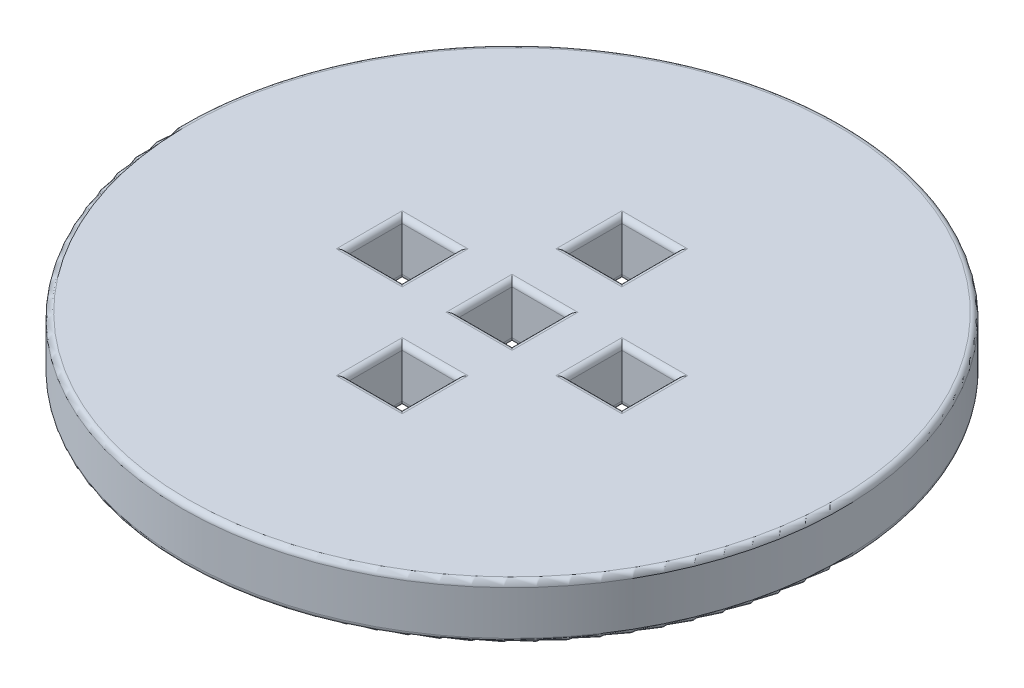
ISO-10303-21;
HEADER;
FILE_DESCRIPTION(('STEP AP214'),'2;1');
FILE_NAME('part.step','',(''),(''),'','','');
FILE_SCHEMA(('AUTOMOTIVE_DESIGN { 1 0 10303 214 1 1 1 1 }'));
ENDSEC;
DATA;
#1=APPLICATION_CONTEXT('core data for automotive mechanical design processes');
#2=APPLICATION_PROTOCOL_DEFINITION('international standard','automotive_design',2000,#1);
#3=PRODUCT_CONTEXT('',#1,'mechanical');
#4=PRODUCT('Part','Part','',(#3));
#5=PRODUCT_RELATED_PRODUCT_CATEGORY('part','',(#4));
#6=PRODUCT_DEFINITION_FORMATION('','',#4);
#7=PRODUCT_DEFINITION_CONTEXT('part definition',#1,'design');
#8=PRODUCT_DEFINITION('design','',#6,#7);
#9=PRODUCT_DEFINITION_SHAPE('','',#8);
#10=(LENGTH_UNIT() NAMED_UNIT(*) SI_UNIT(.MILLI.,.METRE.));
#11=(NAMED_UNIT(*) PLANE_ANGLE_UNIT() SI_UNIT($,.RADIAN.));
#12=(NAMED_UNIT(*) SI_UNIT($,.STERADIAN.) SOLID_ANGLE_UNIT());
#13=UNCERTAINTY_MEASURE_WITH_UNIT(LENGTH_MEASURE(1.E-05),#10,'distance_accuracy_value','');
#14=(GEOMETRIC_REPRESENTATION_CONTEXT(3) GLOBAL_UNCERTAINTY_ASSIGNED_CONTEXT((#13)) GLOBAL_UNIT_ASSIGNED_CONTEXT((#10,
#11,#12)) REPRESENTATION_CONTEXT('',''));
#15=CARTESIAN_POINT('',(0.,0.,0.));
#16=DIRECTION('',(0.,0.,1.));
#17=DIRECTION('',(1.,0.,0.));
#18=AXIS2_PLACEMENT_3D('',#15,#16,#17);
#19=CARTESIAN_POINT('',(0.,5.,0.));
#20=DIRECTION('',(0.,-1.,0.));
#21=DIRECTION('',(0.,0.,-1.));
#22=AXIS2_PLACEMENT_3D('',#19,#20,#21);
#23=CYLINDRICAL_SURFACE('',#22,30.);
#24=CARTESIAN_POINT('',(0.,4.5,0.));
#25=DIRECTION('',(0.,1.,0.));
#26=DIRECTION('',(0.,0.,1.));
#27=AXIS2_PLACEMENT_3D('',#24,#25,#26);
#28=CIRCLE('',#27,30.);
#29=CARTESIAN_POINT('',(0.,4.5,30.));
#30=VERTEX_POINT('',#29);
#31=EDGE_CURVE('E432',#30,#30,#28,.F.);
#32=ORIENTED_EDGE('',*,*,#31,.T.);
#33=EDGE_LOOP('',(#32));
#34=FACE_BOUND('',#33,.T.);
#35=CARTESIAN_POINT('',(0.,0.5,0.));
#36=DIRECTION('',(0.,1.,0.));
#37=DIRECTION('',(0.,0.,1.));
#38=AXIS2_PLACEMENT_3D('',#35,#36,#37);
#39=CIRCLE('',#38,30.);
#40=CARTESIAN_POINT('',(0.,0.5,30.));
#41=VERTEX_POINT('',#40);
#42=EDGE_CURVE('E563',#41,#41,#39,.T.);
#43=ORIENTED_EDGE('',*,*,#42,.T.);
#44=EDGE_LOOP('',(#43));
#45=FACE_BOUND('',#44,.T.);
#46=ADVANCED_FACE('F33',(#34,#45),#23,.T.);
#47=CARTESIAN_POINT('',(0.,5.,0.));
#48=DIRECTION('',(0.,1.,0.));
#49=DIRECTION('',(0.,0.,1.));
#50=AXIS2_PLACEMENT_3D('',#47,#48,#49);
#51=PLANE('',#50);
#52=CARTESIAN_POINT('',(0.,5.,0.));
#53=DIRECTION('',(0.,1.,0.));
#54=DIRECTION('',(0.,0.,1.));
#55=AXIS2_PLACEMENT_3D('',#52,#53,#54);
#56=CIRCLE('',#55,29.5);
#57=CARTESIAN_POINT('',(0.,5.,29.5));
#58=VERTEX_POINT('',#57);
#59=EDGE_CURVE('E429',#58,#58,#56,.T.);
#60=ORIENTED_EDGE('',*,*,#59,.T.);
#61=EDGE_LOOP('',(#60));
#62=FACE_BOUND('',#61,.T.);
#63=DIRECTION('',(0.,0.,1.));
#64=VECTOR('',#63,1.);
#65=CARTESIAN_POINT('',(-3.,5.,7.5));
#66=LINE('',#65,#64);
#67=CARTESIAN_POINT('',(-3.,5.,13.));
#68=VERTEX_POINT('',#67);
#69=CARTESIAN_POINT('',(-3.,5.,7.));
#70=VERTEX_POINT('',#69);
#71=EDGE_CURVE('E424',#68,#70,#66,.F.);
#72=ORIENTED_EDGE('',*,*,#71,.T.);
#73=DIRECTION('',(-1.,0.,0.));
#74=VECTOR('',#73,1.);
#75=CARTESIAN_POINT('',(2.5,5.,7.));
#76=LINE('',#75,#74);
#77=CARTESIAN_POINT('',(3.,5.,7.));
#78=VERTEX_POINT('',#77);
#79=EDGE_CURVE('E426',#70,#78,#76,.F.);
#80=ORIENTED_EDGE('',*,*,#79,.T.);
#81=DIRECTION('',(0.,0.,-1.));
#82=VECTOR('',#81,1.);
#83=CARTESIAN_POINT('',(3.,5.,12.5));
#84=LINE('',#83,#82);
#85=CARTESIAN_POINT('',(3.,5.,13.));
#86=VERTEX_POINT('',#85);
#87=EDGE_CURVE('E420',#78,#86,#84,.F.);
#88=ORIENTED_EDGE('',*,*,#87,.T.);
#89=DIRECTION('',(1.,0.,0.));
#90=VECTOR('',#89,1.);
#91=CARTESIAN_POINT('',(-2.5,5.,13.));
#92=LINE('',#91,#90);
#93=EDGE_CURVE('E422',#86,#68,#92,.F.);
#94=ORIENTED_EDGE('',*,*,#93,.T.);
#95=EDGE_LOOP('',(#72,#80,#88,#94));
#96=FACE_BOUND('',#95,.T.);
#97=DIRECTION('',(0.,0.,1.));
#98=VECTOR('',#97,1.);
#99=CARTESIAN_POINT('',(-3.,5.,-12.5));
#100=LINE('',#99,#98);
#101=CARTESIAN_POINT('',(-3.,5.,-7.));
#102=VERTEX_POINT('',#101);
#103=CARTESIAN_POINT('',(-3.,5.,-13.));
#104=VERTEX_POINT('',#103);
#105=EDGE_CURVE('E411',#102,#104,#100,.F.);
#106=ORIENTED_EDGE('',*,*,#105,.T.);
#107=DIRECTION('',(-1.,0.,0.));
#108=VECTOR('',#107,1.);
#109=CARTESIAN_POINT('',(2.5,5.,-13.));
#110=LINE('',#109,#108);
#111=CARTESIAN_POINT('',(3.,5.,-13.));
#112=VERTEX_POINT('',#111);
#113=EDGE_CURVE('E413',#104,#112,#110,.F.);
#114=ORIENTED_EDGE('',*,*,#113,.T.);
#115=DIRECTION('',(0.,0.,-1.));
#116=VECTOR('',#115,1.);
#117=CARTESIAN_POINT('',(3.,5.,-7.5));
#118=LINE('',#117,#116);
#119=CARTESIAN_POINT('',(3.,5.,-7.));
#120=VERTEX_POINT('',#119);
#121=EDGE_CURVE('E407',#112,#120,#118,.F.);
#122=ORIENTED_EDGE('',*,*,#121,.T.);
#123=DIRECTION('',(1.,0.,0.));
#124=VECTOR('',#123,1.);
#125=CARTESIAN_POINT('',(-2.5,5.,-7.));
#126=LINE('',#125,#124);
#127=EDGE_CURVE('E409',#120,#102,#126,.F.);
#128=ORIENTED_EDGE('',*,*,#127,.T.);
#129=EDGE_LOOP('',(#106,#114,#122,#128));
#130=FACE_BOUND('',#129,.T.);
#131=DIRECTION('',(0.,0.,-1.));
#132=VECTOR('',#131,1.);
#133=CARTESIAN_POINT('',(13.,5.,2.5));
#134=LINE('',#133,#132);
#135=CARTESIAN_POINT('',(13.,5.,-3.));
#136=VERTEX_POINT('',#135);
#137=CARTESIAN_POINT('',(13.,5.,3.));
#138=VERTEX_POINT('',#137);
#139=EDGE_CURVE('E398',#136,#138,#134,.F.);
#140=ORIENTED_EDGE('',*,*,#139,.T.);
#141=DIRECTION('',(1.,0.,0.));
#142=VECTOR('',#141,1.);
#143=CARTESIAN_POINT('',(7.5,5.,3.));
#144=LINE('',#143,#142);
#145=CARTESIAN_POINT('',(7.,5.,3.));
#146=VERTEX_POINT('',#145);
#147=EDGE_CURVE('E400',#138,#146,#144,.F.);
#148=ORIENTED_EDGE('',*,*,#147,.T.);
#149=DIRECTION('',(0.,0.,1.));
#150=VECTOR('',#149,1.);
#151=CARTESIAN_POINT('',(7.,5.,-2.5));
#152=LINE('',#151,#150);
#153=CARTESIAN_POINT('',(7.,5.,-3.));
#154=VERTEX_POINT('',#153);
#155=EDGE_CURVE('E392',#146,#154,#152,.F.);
#156=ORIENTED_EDGE('',*,*,#155,.T.);
#157=DIRECTION('',(-1.,0.,0.));
#158=VECTOR('',#157,1.);
#159=CARTESIAN_POINT('',(12.5,5.,-3.));
#160=LINE('',#159,#158);
#161=EDGE_CURVE('E396',#154,#136,#160,.F.);
#162=ORIENTED_EDGE('',*,*,#161,.T.);
#163=EDGE_LOOP('',(#140,#148,#156,#162));
#164=FACE_BOUND('',#163,.T.);
#165=DIRECTION('',(1.,0.,0.));
#166=VECTOR('',#165,1.);
#167=CARTESIAN_POINT('',(-12.5,5.,3.));
#168=LINE('',#167,#166);
#169=CARTESIAN_POINT('',(-7.,5.,3.));
#170=VERTEX_POINT('',#169);
#171=CARTESIAN_POINT('',(-13.,5.,3.));
#172=VERTEX_POINT('',#171);
#173=EDGE_CURVE('E504',#170,#172,#168,.F.);
#174=ORIENTED_EDGE('',*,*,#173,.T.);
#175=DIRECTION('',(0.,0.,1.));
#176=VECTOR('',#175,1.);
#177=CARTESIAN_POINT('',(-13.,5.,-2.5));
#178=LINE('',#177,#176);
#179=CARTESIAN_POINT('',(-13.,5.,-3.));
#180=VERTEX_POINT('',#179);
#181=EDGE_CURVE('E511',#172,#180,#178,.F.);
#182=ORIENTED_EDGE('',*,*,#181,.T.);
#183=DIRECTION('',(-1.,0.,0.));
#184=VECTOR('',#183,1.);
#185=CARTESIAN_POINT('',(-7.5,5.,-3.));
#186=LINE('',#185,#184);
#187=CARTESIAN_POINT('',(-7.,5.,-3.));
#188=VERTEX_POINT('',#187);
#189=EDGE_CURVE('E322',#180,#188,#186,.F.);
#190=ORIENTED_EDGE('',*,*,#189,.T.);
#191=DIRECTION('',(0.,0.,-1.));
#192=VECTOR('',#191,1.);
#193=CARTESIAN_POINT('',(-7.,5.,2.5));
#194=LINE('',#193,#192);
#195=EDGE_CURVE('E545',#188,#170,#194,.F.);
#196=ORIENTED_EDGE('',*,*,#195,.T.);
#197=EDGE_LOOP('',(#174,#182,#190,#196));
#198=FACE_BOUND('',#197,.T.);
#199=DIRECTION('',(1.,0.,0.));
#200=VECTOR('',#199,1.);
#201=CARTESIAN_POINT('',(-2.5,5.,3.));
#202=LINE('',#201,#200);
#203=CARTESIAN_POINT('',(3.,5.,3.));
#204=VERTEX_POINT('',#203);
#205=CARTESIAN_POINT('',(-3.,5.,3.));
#206=VERTEX_POINT('',#205);
#207=EDGE_CURVE('E507',#204,#206,#202,.F.);
#208=ORIENTED_EDGE('',*,*,#207,.T.);
#209=DIRECTION('',(0.,0.,1.));
#210=VECTOR('',#209,1.);
#211=CARTESIAN_POINT('',(-3.,5.,-2.5));
#212=LINE('',#211,#210);
#213=CARTESIAN_POINT('',(-3.,5.,-3.));
#214=VERTEX_POINT('',#213);
#215=EDGE_CURVE('E418',#206,#214,#212,.F.);
#216=ORIENTED_EDGE('',*,*,#215,.T.);
#217=DIRECTION('',(-1.,0.,0.));
#218=VECTOR('',#217,1.);
#219=CARTESIAN_POINT('',(3.,5.,-3.));
#220=LINE('',#219,#218);
#221=CARTESIAN_POINT('',(3.,5.,-3.));
#222=VERTEX_POINT('',#221);
#223=EDGE_CURVE('E416',#214,#222,#220,.F.);
#224=ORIENTED_EDGE('',*,*,#223,.T.);
#225=DIRECTION('',(0.,0.,-1.));
#226=VECTOR('',#225,1.);
#227=CARTESIAN_POINT('',(3.,5.,2.5));
#228=LINE('',#227,#226);
#229=EDGE_CURVE('E299',#222,#204,#228,.F.);
#230=ORIENTED_EDGE('',*,*,#229,.T.);
#231=EDGE_LOOP('',(#208,#216,#224,#230));
#232=FACE_BOUND('',#231,.T.);
#233=ADVANCED_FACE('F491',(#62,#96,#130,#164,#198,#232),#51,.T.);
#234=CARTESIAN_POINT('',(0.,0.,0.));
#235=DIRECTION('',(0.,1.,0.));
#236=DIRECTION('',(0.,0.,1.));
#237=AXIS2_PLACEMENT_3D('',#234,#235,#236);
#238=PLANE('',#237);
#239=CARTESIAN_POINT('',(0.,0.,0.));
#240=DIRECTION('',(0.,1.,0.));
#241=DIRECTION('',(0.,0.,1.));
#242=AXIS2_PLACEMENT_3D('',#239,#240,#241);
#243=CIRCLE('',#242,29.5);
#244=CARTESIAN_POINT('',(0.,0.,29.5));
#245=VERTEX_POINT('',#244);
#246=EDGE_CURVE('E626',#245,#245,#243,.F.);
#247=ORIENTED_EDGE('',*,*,#246,.T.);
#248=EDGE_LOOP('',(#247));
#249=FACE_BOUND('',#248,.T.);
#250=DIRECTION('',(-1.,0.,0.));
#251=VECTOR('',#250,1.);
#252=CARTESIAN_POINT('',(0.,0.,3.));
#253=LINE('',#252,#251);
#254=CARTESIAN_POINT('',(-3.,0.,3.));
#255=VERTEX_POINT('',#254);
#256=CARTESIAN_POINT('',(3.,0.,3.));
#257=VERTEX_POINT('',#256);
#258=EDGE_CURVE('E621',#255,#257,#253,.F.);
#259=ORIENTED_EDGE('',*,*,#258,.T.);
#260=DIRECTION('',(0.,0.,1.));
#261=VECTOR('',#260,1.);
#262=CARTESIAN_POINT('',(3.,0.,0.));
#263=LINE('',#262,#261);
#264=CARTESIAN_POINT('',(3.,0.,-3.));
#265=VERTEX_POINT('',#264);
#266=EDGE_CURVE('E623',#257,#265,#263,.F.);
#267=ORIENTED_EDGE('',*,*,#266,.T.);
#268=DIRECTION('',(1.,0.,0.));
#269=VECTOR('',#268,1.);
#270=CARTESIAN_POINT('',(0.,0.,-3.));
#271=LINE('',#270,#269);
#272=CARTESIAN_POINT('',(-3.,0.,-3.));
#273=VERTEX_POINT('',#272);
#274=EDGE_CURVE('E617',#265,#273,#271,.F.);
#275=ORIENTED_EDGE('',*,*,#274,.T.);
#276=DIRECTION('',(0.,0.,-1.));
#277=VECTOR('',#276,1.);
#278=CARTESIAN_POINT('',(-3.,0.,0.));
#279=LINE('',#278,#277);
#280=EDGE_CURVE('E619',#273,#255,#279,.F.);
#281=ORIENTED_EDGE('',*,*,#280,.T.);
#282=EDGE_LOOP('',(#259,#267,#275,#281));
#283=FACE_BOUND('',#282,.T.);
#284=DIRECTION('',(-1.,0.,0.));
#285=VECTOR('',#284,1.);
#286=CARTESIAN_POINT('',(0.,0.,13.));
#287=LINE('',#286,#285);
#288=CARTESIAN_POINT('',(-3.,0.,13.));
#289=VERTEX_POINT('',#288);
#290=CARTESIAN_POINT('',(3.,0.,13.));
#291=VERTEX_POINT('',#290);
#292=EDGE_CURVE('E612',#289,#291,#287,.F.);
#293=ORIENTED_EDGE('',*,*,#292,.T.);
#294=DIRECTION('',(0.,0.,1.));
#295=VECTOR('',#294,1.);
#296=CARTESIAN_POINT('',(3.,0.,0.));
#297=LINE('',#296,#295);
#298=CARTESIAN_POINT('',(3.,0.,7.));
#299=VERTEX_POINT('',#298);
#300=EDGE_CURVE('E614',#291,#299,#297,.F.);
#301=ORIENTED_EDGE('',*,*,#300,.T.);
#302=DIRECTION('',(1.,0.,0.));
#303=VECTOR('',#302,1.);
#304=CARTESIAN_POINT('',(0.,0.,7.));
#305=LINE('',#304,#303);
#306=CARTESIAN_POINT('',(-3.,0.,7.));
#307=VERTEX_POINT('',#306);
#308=EDGE_CURVE('E608',#299,#307,#305,.F.);
#309=ORIENTED_EDGE('',*,*,#308,.T.);
#310=DIRECTION('',(0.,0.,-1.));
#311=VECTOR('',#310,1.);
#312=CARTESIAN_POINT('',(-3.,0.,0.));
#313=LINE('',#312,#311);
#314=EDGE_CURVE('E610',#307,#289,#313,.F.);
#315=ORIENTED_EDGE('',*,*,#314,.T.);
#316=EDGE_LOOP('',(#293,#301,#309,#315));
#317=FACE_BOUND('',#316,.T.);
#318=DIRECTION('',(-1.,0.,0.));
#319=VECTOR('',#318,1.);
#320=CARTESIAN_POINT('',(0.,0.,3.));
#321=LINE('',#320,#319);
#322=CARTESIAN_POINT('',(-13.,0.,3.));
#323=VERTEX_POINT('',#322);
#324=CARTESIAN_POINT('',(-7.,0.,3.));
#325=VERTEX_POINT('',#324);
#326=EDGE_CURVE('E603',#323,#325,#321,.F.);
#327=ORIENTED_EDGE('',*,*,#326,.T.);
#328=DIRECTION('',(0.,0.,1.));
#329=VECTOR('',#328,1.);
#330=CARTESIAN_POINT('',(-7.,0.,0.));
#331=LINE('',#330,#329);
#332=CARTESIAN_POINT('',(-7.,0.,-3.));
#333=VERTEX_POINT('',#332);
#334=EDGE_CURVE('E605',#325,#333,#331,.F.);
#335=ORIENTED_EDGE('',*,*,#334,.T.);
#336=DIRECTION('',(1.,0.,0.));
#337=VECTOR('',#336,1.);
#338=CARTESIAN_POINT('',(0.,0.,-3.));
#339=LINE('',#338,#337);
#340=CARTESIAN_POINT('',(-13.,0.,-3.));
#341=VERTEX_POINT('',#340);
#342=EDGE_CURVE('E599',#333,#341,#339,.F.);
#343=ORIENTED_EDGE('',*,*,#342,.T.);
#344=DIRECTION('',(0.,0.,-1.));
#345=VECTOR('',#344,1.);
#346=CARTESIAN_POINT('',(-13.,0.,0.));
#347=LINE('',#346,#345);
#348=EDGE_CURVE('E601',#341,#323,#347,.F.);
#349=ORIENTED_EDGE('',*,*,#348,.T.);
#350=EDGE_LOOP('',(#327,#335,#343,#349));
#351=FACE_BOUND('',#350,.T.);
#352=DIRECTION('',(-1.,0.,0.));
#353=VECTOR('',#352,1.);
#354=CARTESIAN_POINT('',(0.,0.,3.));
#355=LINE('',#354,#353);
#356=CARTESIAN_POINT('',(7.,0.,3.));
#357=VERTEX_POINT('',#356);
#358=CARTESIAN_POINT('',(13.,0.,3.));
#359=VERTEX_POINT('',#358);
#360=EDGE_CURVE('E594',#357,#359,#355,.F.);
#361=ORIENTED_EDGE('',*,*,#360,.T.);
#362=DIRECTION('',(0.,0.,1.));
#363=VECTOR('',#362,1.);
#364=CARTESIAN_POINT('',(13.,0.,0.));
#365=LINE('',#364,#363);
#366=CARTESIAN_POINT('',(13.,0.,-3.));
#367=VERTEX_POINT('',#366);
#368=EDGE_CURVE('E596',#359,#367,#365,.F.);
#369=ORIENTED_EDGE('',*,*,#368,.T.);
#370=DIRECTION('',(1.,0.,0.));
#371=VECTOR('',#370,1.);
#372=CARTESIAN_POINT('',(0.,0.,-3.));
#373=LINE('',#372,#371);
#374=CARTESIAN_POINT('',(7.,0.,-3.));
#375=VERTEX_POINT('',#374);
#376=EDGE_CURVE('E590',#367,#375,#373,.F.);
#377=ORIENTED_EDGE('',*,*,#376,.T.);
#378=DIRECTION('',(0.,0.,-1.));
#379=VECTOR('',#378,1.);
#380=CARTESIAN_POINT('',(7.,0.,0.));
#381=LINE('',#380,#379);
#382=EDGE_CURVE('E592',#375,#357,#381,.F.);
#383=ORIENTED_EDGE('',*,*,#382,.T.);
#384=EDGE_LOOP('',(#361,#369,#377,#383));
#385=FACE_BOUND('',#384,.T.);
#386=DIRECTION('',(1.,0.,0.));
#387=VECTOR('',#386,1.);
#388=CARTESIAN_POINT('',(0.,0.,-13.));
#389=LINE('',#388,#387);
#390=CARTESIAN_POINT('',(3.,0.,-13.));
#391=VERTEX_POINT('',#390);
#392=CARTESIAN_POINT('',(-3.,0.,-13.));
#393=VERTEX_POINT('',#392);
#394=EDGE_CURVE('E585',#391,#393,#389,.F.);
#395=ORIENTED_EDGE('',*,*,#394,.T.);
#396=DIRECTION('',(0.,0.,-1.));
#397=VECTOR('',#396,1.);
#398=CARTESIAN_POINT('',(-3.,0.,0.));
#399=LINE('',#398,#397);
#400=CARTESIAN_POINT('',(-3.,0.,-7.));
#401=VERTEX_POINT('',#400);
#402=EDGE_CURVE('E587',#393,#401,#399,.F.);
#403=ORIENTED_EDGE('',*,*,#402,.T.);
#404=DIRECTION('',(-1.,0.,0.));
#405=VECTOR('',#404,1.);
#406=CARTESIAN_POINT('',(0.,0.,-7.));
#407=LINE('',#406,#405);
#408=CARTESIAN_POINT('',(3.,0.,-7.));
#409=VERTEX_POINT('',#408);
#410=EDGE_CURVE('E581',#401,#409,#407,.F.);
#411=ORIENTED_EDGE('',*,*,#410,.T.);
#412=DIRECTION('',(0.,0.,1.));
#413=VECTOR('',#412,1.);
#414=CARTESIAN_POINT('',(3.,0.,0.));
#415=LINE('',#414,#413);
#416=EDGE_CURVE('E583',#409,#391,#415,.F.);
#417=ORIENTED_EDGE('',*,*,#416,.T.);
#418=EDGE_LOOP('',(#395,#403,#411,#417));
#419=FACE_BOUND('',#418,.T.);
#420=ADVANCED_FACE('F494',(#249,#283,#317,#351,#385,#419),#238,.F.);
#421=CARTESIAN_POINT('',(2.5,2.5,7.5));
#422=DIRECTION('',(1.,0.,0.));
#423=DIRECTION('',(0.,0.,-1.));
#424=AXIS2_PLACEMENT_3D('',#421,#422,#423);
#425=PLANE('',#424);
#426=DIRECTION('',(0.,1.,0.));
#427=VECTOR('',#426,1.);
#428=CARTESIAN_POINT('',(2.5,2.5,12.5));
#429=LINE('',#428,#427);
#430=CARTESIAN_POINT('',(2.5,0.5,12.5));
#431=VERTEX_POINT('',#430);
#432=CARTESIAN_POINT('',(2.5,4.5,12.5));
#433=VERTEX_POINT('',#432);
#434=EDGE_CURVE('E323',#431,#433,#429,.T.);
#435=ORIENTED_EDGE('',*,*,#434,.T.);
#436=DIRECTION('',(0.,0.,-1.));
#437=VECTOR('',#436,1.);
#438=CARTESIAN_POINT('',(2.5,4.5,7.5));
#439=LINE('',#438,#437);
#440=CARTESIAN_POINT('',(2.5,4.5,7.5));
#441=VERTEX_POINT('',#440);
#442=EDGE_CURVE('E337',#433,#441,#439,.T.);
#443=ORIENTED_EDGE('',*,*,#442,.T.);
#444=DIRECTION('',(0.,1.,0.));
#445=VECTOR('',#444,1.);
#446=CARTESIAN_POINT('',(2.5,2.5,7.5));
#447=LINE('',#446,#445);
#448=CARTESIAN_POINT('',(2.5,0.5,7.5));
#449=VERTEX_POINT('',#448);
#450=EDGE_CURVE('E448',#449,#441,#447,.T.);
#451=ORIENTED_EDGE('',*,*,#450,.F.);
#452=DIRECTION('',(0.,0.,1.));
#453=VECTOR('',#452,1.);
#454=CARTESIAN_POINT('',(2.5,0.5,7.5));
#455=LINE('',#454,#453);
#456=EDGE_CURVE('E635',#449,#431,#455,.T.);
#457=ORIENTED_EDGE('',*,*,#456,.T.);
#458=EDGE_LOOP('',(#435,#443,#451,#457));
#459=FACE_BOUND('',#458,.T.);
#460=ADVANCED_FACE('F446',(#459),#425,.F.);
#461=CARTESIAN_POINT('',(-2.5,2.5,12.5));
#462=DIRECTION('',(0.,0.,1.));
#463=DIRECTION('',(1.,0.,0.));
#464=AXIS2_PLACEMENT_3D('',#461,#462,#463);
#465=PLANE('',#464);
#466=DIRECTION('',(0.,1.,0.));
#467=VECTOR('',#466,1.);
#468=CARTESIAN_POINT('',(-2.5,2.5,12.5));
#469=LINE('',#468,#467);
#470=CARTESIAN_POINT('',(-2.5,0.5,12.5));
#471=VERTEX_POINT('',#470);
#472=CARTESIAN_POINT('',(-2.5,4.5,12.5));
#473=VERTEX_POINT('',#472);
#474=EDGE_CURVE('E479',#471,#473,#469,.T.);
#475=ORIENTED_EDGE('',*,*,#474,.T.);
#476=DIRECTION('',(1.,0.,0.));
#477=VECTOR('',#476,1.);
#478=CARTESIAN_POINT('',(2.5,4.5,12.5));
#479=LINE('',#478,#477);
#480=EDGE_CURVE('E440',#473,#433,#479,.T.);
#481=ORIENTED_EDGE('',*,*,#480,.T.);
#482=ORIENTED_EDGE('',*,*,#434,.F.);
#483=DIRECTION('',(-1.,0.,0.));
#484=VECTOR('',#483,1.);
#485=CARTESIAN_POINT('',(-2.5,0.5,12.5));
#486=LINE('',#485,#484);
#487=EDGE_CURVE('E485',#431,#471,#486,.T.);
#488=ORIENTED_EDGE('',*,*,#487,.T.);
#489=EDGE_LOOP('',(#475,#481,#482,#488));
#490=FACE_BOUND('',#489,.T.);
#491=ADVANCED_FACE('F483',(#490),#465,.F.);
#492=CARTESIAN_POINT('',(-2.5,2.5,7.5));
#493=DIRECTION('',(-1.,0.,0.));
#494=DIRECTION('',(0.,0.,1.));
#495=AXIS2_PLACEMENT_3D('',#492,#493,#494);
#496=PLANE('',#495);
#497=DIRECTION('',(0.,1.,0.));
#498=VECTOR('',#497,1.);
#499=CARTESIAN_POINT('',(-2.5,2.5,7.5));
#500=LINE('',#499,#498);
#501=CARTESIAN_POINT('',(-2.5,0.5,7.5));
#502=VERTEX_POINT('',#501);
#503=CARTESIAN_POINT('',(-2.5,4.5,7.5));
#504=VERTEX_POINT('',#503);
#505=EDGE_CURVE('E461',#502,#504,#500,.T.);
#506=ORIENTED_EDGE('',*,*,#505,.T.);
#507=DIRECTION('',(0.,0.,1.));
#508=VECTOR('',#507,1.);
#509=CARTESIAN_POINT('',(-2.5,4.5,12.5));
#510=LINE('',#509,#508);
#511=EDGE_CURVE('E438',#504,#473,#510,.T.);
#512=ORIENTED_EDGE('',*,*,#511,.T.);
#513=ORIENTED_EDGE('',*,*,#474,.F.);
#514=DIRECTION('',(0.,0.,-1.));
#515=VECTOR('',#514,1.);
#516=CARTESIAN_POINT('',(-2.5,0.5,7.5));
#517=LINE('',#516,#515);
#518=EDGE_CURVE('E638',#471,#502,#517,.T.);
#519=ORIENTED_EDGE('',*,*,#518,.T.);
#520=EDGE_LOOP('',(#506,#512,#513,#519));
#521=FACE_BOUND('',#520,.T.);
#522=ADVANCED_FACE('F478',(#521),#496,.F.);
#523=CARTESIAN_POINT('',(-2.5,2.5,7.5));
#524=DIRECTION('',(0.,0.,-1.));
#525=DIRECTION('',(-1.,0.,0.));
#526=AXIS2_PLACEMENT_3D('',#523,#524,#525);
#527=PLANE('',#526);
#528=ORIENTED_EDGE('',*,*,#450,.T.);
#529=DIRECTION('',(-1.,0.,0.));
#530=VECTOR('',#529,1.);
#531=CARTESIAN_POINT('',(-2.5,4.5,7.5));
#532=LINE('',#531,#530);
#533=EDGE_CURVE('E435',#441,#504,#532,.T.);
#534=ORIENTED_EDGE('',*,*,#533,.T.);
#535=ORIENTED_EDGE('',*,*,#505,.F.);
#536=DIRECTION('',(1.,0.,0.));
#537=VECTOR('',#536,1.);
#538=CARTESIAN_POINT('',(-2.5,0.5,7.5));
#539=LINE('',#538,#537);
#540=EDGE_CURVE('E460',#502,#449,#539,.T.);
#541=ORIENTED_EDGE('',*,*,#540,.T.);
#542=EDGE_LOOP('',(#528,#534,#535,#541));
#543=FACE_BOUND('',#542,.T.);
#544=ADVANCED_FACE('F455',(#543),#527,.F.);
#545=CARTESIAN_POINT('',(-12.5,2.5,2.5));
#546=DIRECTION('',(-1.,0.,0.));
#547=DIRECTION('',(0.,0.,1.));
#548=AXIS2_PLACEMENT_3D('',#545,#546,#547);
#549=PLANE('',#548);
#550=DIRECTION('',(0.,1.,0.));
#551=VECTOR('',#550,1.);
#552=CARTESIAN_POINT('',(-12.5,2.5,2.5));
#553=LINE('',#552,#551);
#554=CARTESIAN_POINT('',(-12.5,0.5,2.5));
#555=VERTEX_POINT('',#554);
#556=CARTESIAN_POINT('',(-12.5,4.5,2.5));
#557=VERTEX_POINT('',#556);
#558=EDGE_CURVE('E540',#555,#557,#553,.T.);
#559=ORIENTED_EDGE('',*,*,#558,.F.);
#560=DIRECTION('',(0.,0.,-1.));
#561=VECTOR('',#560,1.);
#562=CARTESIAN_POINT('',(-12.5,0.5,2.5));
#563=LINE('',#562,#561);
#564=CARTESIAN_POINT('',(-12.5,0.5,-2.5));
#565=VERTEX_POINT('',#564);
#566=EDGE_CURVE('E646',#555,#565,#563,.T.);
#567=ORIENTED_EDGE('',*,*,#566,.T.);
#568=DIRECTION('',(0.,1.,0.));
#569=VECTOR('',#568,1.);
#570=CARTESIAN_POINT('',(-12.5,2.5,-2.5));
#571=LINE('',#570,#569);
#572=CARTESIAN_POINT('',(-12.5,4.5,-2.5));
#573=VERTEX_POINT('',#572);
#574=EDGE_CURVE('E462',#565,#573,#571,.T.);
#575=ORIENTED_EDGE('',*,*,#574,.T.);
#576=DIRECTION('',(0.,0.,1.));
#577=VECTOR('',#576,1.);
#578=CARTESIAN_POINT('',(-12.5,4.5,2.5));
#579=LINE('',#578,#577);
#580=EDGE_CURVE('E551',#573,#557,#579,.T.);
#581=ORIENTED_EDGE('',*,*,#580,.T.);
#582=EDGE_LOOP('',(#559,#567,#575,#581));
#583=FACE_BOUND('',#582,.T.);
#584=ADVANCED_FACE('F967',(#583),#549,.F.);
#585=CARTESIAN_POINT('',(-7.5,2.5,-2.5));
#586=DIRECTION('',(0.,0.,-1.));
#587=DIRECTION('',(-1.,0.,0.));
#588=AXIS2_PLACEMENT_3D('',#585,#586,#587);
#589=PLANE('',#588);
#590=ORIENTED_EDGE('',*,*,#574,.F.);
#591=DIRECTION('',(1.,0.,0.));
#592=VECTOR('',#591,1.);
#593=CARTESIAN_POINT('',(-7.5,0.5,-2.5));
#594=LINE('',#593,#592);
#595=CARTESIAN_POINT('',(-7.5,0.5,-2.5));
#596=VERTEX_POINT('',#595);
#597=EDGE_CURVE('E648',#565,#596,#594,.T.);
#598=ORIENTED_EDGE('',*,*,#597,.T.);
#599=DIRECTION('',(0.,1.,0.));
#600=VECTOR('',#599,1.);
#601=CARTESIAN_POINT('',(-7.5,2.5,-2.5));
#602=LINE('',#601,#600);
#603=CARTESIAN_POINT('',(-7.5,4.5,-2.5));
#604=VERTEX_POINT('',#603);
#605=EDGE_CURVE('E536',#596,#604,#602,.T.);
#606=ORIENTED_EDGE('',*,*,#605,.T.);
#607=DIRECTION('',(-1.,0.,0.));
#608=VECTOR('',#607,1.);
#609=CARTESIAN_POINT('',(-12.5,4.5,-2.5));
#610=LINE('',#609,#608);
#611=EDGE_CURVE('E560',#604,#573,#610,.T.);
#612=ORIENTED_EDGE('',*,*,#611,.T.);
#613=EDGE_LOOP('',(#590,#598,#606,#612));
#614=FACE_BOUND('',#613,.T.);
#615=ADVANCED_FACE('F963',(#614),#589,.F.);
#616=CARTESIAN_POINT('',(-7.5,2.5,2.5));
#617=DIRECTION('',(1.,0.,0.));
#618=DIRECTION('',(0.,0.,-1.));
#619=AXIS2_PLACEMENT_3D('',#616,#617,#618);
#620=PLANE('',#619);
#621=ORIENTED_EDGE('',*,*,#605,.F.);
#622=DIRECTION('',(0.,0.,1.));
#623=VECTOR('',#622,1.);
#624=CARTESIAN_POINT('',(-7.5,0.5,2.5));
#625=LINE('',#624,#623);
#626=CARTESIAN_POINT('',(-7.5,0.5,2.5));
#627=VERTEX_POINT('',#626);
#628=EDGE_CURVE('E641',#596,#627,#625,.T.);
#629=ORIENTED_EDGE('',*,*,#628,.T.);
#630=DIRECTION('',(0.,1.,0.));
#631=VECTOR('',#630,1.);
#632=CARTESIAN_POINT('',(-7.5,2.5,2.5));
#633=LINE('',#632,#631);
#634=CARTESIAN_POINT('',(-7.5,4.5,2.5));
#635=VERTEX_POINT('',#634);
#636=EDGE_CURVE('E538',#627,#635,#633,.T.);
#637=ORIENTED_EDGE('',*,*,#636,.T.);
#638=DIRECTION('',(0.,0.,-1.));
#639=VECTOR('',#638,1.);
#640=CARTESIAN_POINT('',(-7.5,4.5,-2.5));
#641=LINE('',#640,#639);
#642=EDGE_CURVE('E557',#635,#604,#641,.T.);
#643=ORIENTED_EDGE('',*,*,#642,.T.);
#644=EDGE_LOOP('',(#621,#629,#637,#643));
#645=FACE_BOUND('',#644,.T.);
#646=ADVANCED_FACE('F966',(#645),#620,.F.);
#647=CARTESIAN_POINT('',(-7.5,2.5,2.5));
#648=DIRECTION('',(0.,0.,1.));
#649=DIRECTION('',(1.,0.,0.));
#650=AXIS2_PLACEMENT_3D('',#647,#648,#649);
#651=PLANE('',#650);
#652=ORIENTED_EDGE('',*,*,#636,.F.);
#653=DIRECTION('',(-1.,0.,0.));
#654=VECTOR('',#653,1.);
#655=CARTESIAN_POINT('',(-7.5,0.5,2.5));
#656=LINE('',#655,#654);
#657=EDGE_CURVE('E644',#627,#555,#656,.T.);
#658=ORIENTED_EDGE('',*,*,#657,.T.);
#659=ORIENTED_EDGE('',*,*,#558,.T.);
#660=DIRECTION('',(1.,0.,0.));
#661=VECTOR('',#660,1.);
#662=CARTESIAN_POINT('',(-7.5,4.5,2.5));
#663=LINE('',#662,#661);
#664=EDGE_CURVE('E554',#557,#635,#663,.T.);
#665=ORIENTED_EDGE('',*,*,#664,.T.);
#666=EDGE_LOOP('',(#652,#658,#659,#665));
#667=FACE_BOUND('',#666,.T.);
#668=ADVANCED_FACE('F962',(#667),#651,.F.);
#669=CARTESIAN_POINT('',(-2.5,2.5,2.5));
#670=DIRECTION('',(-1.,0.,0.));
#671=DIRECTION('',(0.,0.,1.));
#672=AXIS2_PLACEMENT_3D('',#669,#670,#671);
#673=PLANE('',#672);
#674=DIRECTION('',(0.,1.,0.));
#675=VECTOR('',#674,1.);
#676=CARTESIAN_POINT('',(-2.5,2.5,-2.5));
#677=LINE('',#676,#675);
#678=CARTESIAN_POINT('',(-2.5,0.5,-2.5));
#679=VERTEX_POINT('',#678);
#680=CARTESIAN_POINT('',(-2.5,4.5,-2.5));
#681=VERTEX_POINT('',#680);
#682=EDGE_CURVE('E316',#679,#681,#677,.T.);
#683=ORIENTED_EDGE('',*,*,#682,.T.);
#684=DIRECTION('',(0.,0.,1.));
#685=VECTOR('',#684,1.);
#686=CARTESIAN_POINT('',(-2.5,4.5,3.));
#687=LINE('',#686,#685);
#688=CARTESIAN_POINT('',(-2.5,4.5,2.5));
#689=VERTEX_POINT('',#688);
#690=EDGE_CURVE('E331',#681,#689,#687,.T.);
#691=ORIENTED_EDGE('',*,*,#690,.T.);
#692=DIRECTION('',(0.,1.,0.));
#693=VECTOR('',#692,1.);
#694=CARTESIAN_POINT('',(-2.5,2.5,2.5));
#695=LINE('',#694,#693);
#696=CARTESIAN_POINT('',(-2.5,0.5,2.5));
#697=VERTEX_POINT('',#696);
#698=EDGE_CURVE('E522',#697,#689,#695,.T.);
#699=ORIENTED_EDGE('',*,*,#698,.F.);
#700=DIRECTION('',(0.,0.,-1.));
#701=VECTOR('',#700,1.);
#702=CARTESIAN_POINT('',(-2.5,0.5,2.5));
#703=LINE('',#702,#701);
#704=EDGE_CURVE('E632',#697,#679,#703,.T.);
#705=ORIENTED_EDGE('',*,*,#704,.T.);
#706=EDGE_LOOP('',(#683,#691,#699,#705));
#707=FACE_BOUND('',#706,.T.);
#708=ADVANCED_FACE('F521',(#707),#673,.F.);
#709=CARTESIAN_POINT('',(2.5,2.5,-2.5));
#710=DIRECTION('',(0.,0.,-1.));
#711=DIRECTION('',(-1.,0.,0.));
#712=AXIS2_PLACEMENT_3D('',#709,#710,#711);
#713=PLANE('',#712);
#714=DIRECTION('',(0.,1.,0.));
#715=VECTOR('',#714,1.);
#716=CARTESIAN_POINT('',(2.5,2.5,-2.5));
#717=LINE('',#716,#715);
#718=CARTESIAN_POINT('',(2.5,0.5,-2.5));
#719=VERTEX_POINT('',#718);
#720=CARTESIAN_POINT('',(2.5,4.5,-2.5));
#721=VERTEX_POINT('',#720);
#722=EDGE_CURVE('E306',#719,#721,#717,.T.);
#723=ORIENTED_EDGE('',*,*,#722,.T.);
#724=DIRECTION('',(-1.,0.,0.));
#725=VECTOR('',#724,1.);
#726=CARTESIAN_POINT('',(-2.5,4.5,-2.5));
#727=LINE('',#726,#725);
#728=EDGE_CURVE('E309',#721,#681,#727,.T.);
#729=ORIENTED_EDGE('',*,*,#728,.T.);
#730=ORIENTED_EDGE('',*,*,#682,.F.);
#731=DIRECTION('',(1.,0.,0.));
#732=VECTOR('',#731,1.);
#733=CARTESIAN_POINT('',(2.5,0.5,-2.5));
#734=LINE('',#733,#732);
#735=EDGE_CURVE('E312',#679,#719,#734,.T.);
#736=ORIENTED_EDGE('',*,*,#735,.T.);
#737=EDGE_LOOP('',(#723,#729,#730,#736));
#738=FACE_BOUND('',#737,.T.);
#739=ADVANCED_FACE('F307',(#738),#713,.F.);
#740=CARTESIAN_POINT('',(2.5,2.5,2.5));
#741=DIRECTION('',(1.,0.,0.));
#742=DIRECTION('',(0.,0.,-1.));
#743=AXIS2_PLACEMENT_3D('',#740,#741,#742);
#744=PLANE('',#743);
#745=ORIENTED_EDGE('',*,*,#722,.F.);
#746=DIRECTION('',(0.,0.,1.));
#747=VECTOR('',#746,1.);
#748=CARTESIAN_POINT('',(2.5,0.5,2.5));
#749=LINE('',#748,#747);
#750=CARTESIAN_POINT('',(2.5,0.5,2.5));
#751=VERTEX_POINT('',#750);
#752=EDGE_CURVE('E629',#719,#751,#749,.T.);
#753=ORIENTED_EDGE('',*,*,#752,.T.);
#754=DIRECTION('',(0.,1.,0.));
#755=VECTOR('',#754,1.);
#756=CARTESIAN_POINT('',(2.5,2.5,2.5));
#757=LINE('',#756,#755);
#758=CARTESIAN_POINT('',(2.5,4.5,2.5));
#759=VERTEX_POINT('',#758);
#760=EDGE_CURVE('E317',#751,#759,#757,.T.);
#761=ORIENTED_EDGE('',*,*,#760,.T.);
#762=DIRECTION('',(0.,0.,-1.));
#763=VECTOR('',#762,1.);
#764=CARTESIAN_POINT('',(2.5,4.5,-2.5));
#765=LINE('',#764,#763);
#766=EDGE_CURVE('E298',#759,#721,#765,.T.);
#767=ORIENTED_EDGE('',*,*,#766,.T.);
#768=EDGE_LOOP('',(#745,#753,#761,#767));
#769=FACE_BOUND('',#768,.T.);
#770=ADVANCED_FACE('F319',(#769),#744,.F.);
#771=CARTESIAN_POINT('',(2.5,2.5,2.5));
#772=DIRECTION('',(0.,0.,1.));
#773=DIRECTION('',(1.,0.,0.));
#774=AXIS2_PLACEMENT_3D('',#771,#772,#773);
#775=PLANE('',#774);
#776=ORIENTED_EDGE('',*,*,#760,.F.);
#777=DIRECTION('',(-1.,0.,0.));
#778=VECTOR('',#777,1.);
#779=CARTESIAN_POINT('',(2.5,0.5,2.5));
#780=LINE('',#779,#778);
#781=EDGE_CURVE('E527',#751,#697,#780,.T.);
#782=ORIENTED_EDGE('',*,*,#781,.T.);
#783=ORIENTED_EDGE('',*,*,#698,.T.);
#784=DIRECTION('',(1.,0.,0.));
#785=VECTOR('',#784,1.);
#786=CARTESIAN_POINT('',(2.5,4.5,2.5));
#787=LINE('',#786,#785);
#788=EDGE_CURVE('E515',#689,#759,#787,.T.);
#789=ORIENTED_EDGE('',*,*,#788,.T.);
#790=EDGE_LOOP('',(#776,#782,#783,#789));
#791=FACE_BOUND('',#790,.T.);
#792=ADVANCED_FACE('F525',(#791),#775,.F.);
#793=CARTESIAN_POINT('',(2.5,2.5,-12.5));
#794=DIRECTION('',(1.,0.,0.));
#795=DIRECTION('',(0.,0.,-1.));
#796=AXIS2_PLACEMENT_3D('',#793,#794,#795);
#797=PLANE('',#796);
#798=DIRECTION('',(0.,1.,0.));
#799=VECTOR('',#798,1.);
#800=CARTESIAN_POINT('',(2.5,2.5,-7.5));
#801=LINE('',#800,#799);
#802=CARTESIAN_POINT('',(2.5,0.5,-7.5));
#803=VERTEX_POINT('',#802);
#804=CARTESIAN_POINT('',(2.5,4.5,-7.5));
#805=VERTEX_POINT('',#804);
#806=EDGE_CURVE('E528',#803,#805,#801,.T.);
#807=ORIENTED_EDGE('',*,*,#806,.T.);
#808=DIRECTION('',(0.,0.,-1.));
#809=VECTOR('',#808,1.);
#810=CARTESIAN_POINT('',(2.5,4.5,-12.5));
#811=LINE('',#810,#809);
#812=CARTESIAN_POINT('',(2.5,4.5,-12.5));
#813=VERTEX_POINT('',#812);
#814=EDGE_CURVE('E344',#805,#813,#811,.T.);
#815=ORIENTED_EDGE('',*,*,#814,.T.);
#816=DIRECTION('',(0.,1.,0.));
#817=VECTOR('',#816,1.);
#818=CARTESIAN_POINT('',(2.5,2.5,-12.5));
#819=LINE('',#818,#817);
#820=CARTESIAN_POINT('',(2.5,0.5,-12.5));
#821=VERTEX_POINT('',#820);
#822=EDGE_CURVE('E746',#821,#813,#819,.T.);
#823=ORIENTED_EDGE('',*,*,#822,.F.);
#824=DIRECTION('',(0.,0.,1.));
#825=VECTOR('',#824,1.);
#826=CARTESIAN_POINT('',(2.5,0.5,-12.5));
#827=LINE('',#826,#825);
#828=EDGE_CURVE('E664',#821,#803,#827,.T.);
#829=ORIENTED_EDGE('',*,*,#828,.T.);
#830=EDGE_LOOP('',(#807,#815,#823,#829));
#831=FACE_BOUND('',#830,.T.);
#832=ADVANCED_FACE('F937',(#831),#797,.F.);
#833=CARTESIAN_POINT('',(-2.5,2.5,-7.5));
#834=DIRECTION('',(0.,0.,1.));
#835=DIRECTION('',(1.,0.,0.));
#836=AXIS2_PLACEMENT_3D('',#833,#834,#835);
#837=PLANE('',#836);
#838=DIRECTION('',(0.,1.,0.));
#839=VECTOR('',#838,1.);
#840=CARTESIAN_POINT('',(-2.5,2.5,-7.5));
#841=LINE('',#840,#839);
#842=CARTESIAN_POINT('',(-2.5,0.5,-7.5));
#843=VERTEX_POINT('',#842);
#844=CARTESIAN_POINT('',(-2.5,4.5,-7.5));
#845=VERTEX_POINT('',#844);
#846=EDGE_CURVE('E532',#843,#845,#841,.T.);
#847=ORIENTED_EDGE('',*,*,#846,.T.);
#848=DIRECTION('',(1.,0.,0.));
#849=VECTOR('',#848,1.);
#850=CARTESIAN_POINT('',(2.5,4.5,-7.5));
#851=LINE('',#850,#849);
#852=EDGE_CURVE('E342',#845,#805,#851,.T.);
#853=ORIENTED_EDGE('',*,*,#852,.T.);
#854=ORIENTED_EDGE('',*,*,#806,.F.);
#855=DIRECTION('',(-1.,0.,0.));
#856=VECTOR('',#855,1.);
#857=CARTESIAN_POINT('',(-2.5,0.5,-7.5));
#858=LINE('',#857,#856);
#859=EDGE_CURVE('E402',#803,#843,#858,.T.);
#860=ORIENTED_EDGE('',*,*,#859,.T.);
#861=EDGE_LOOP('',(#847,#853,#854,#860));
#862=FACE_BOUND('',#861,.T.);
#863=ADVANCED_FACE('F940',(#862),#837,.F.);
#864=CARTESIAN_POINT('',(-2.5,2.5,-12.5));
#865=DIRECTION('',(-1.,0.,0.));
#866=DIRECTION('',(0.,0.,1.));
#867=AXIS2_PLACEMENT_3D('',#864,#865,#866);
#868=PLANE('',#867);
#869=DIRECTION('',(0.,1.,0.));
#870=VECTOR('',#869,1.);
#871=CARTESIAN_POINT('',(-2.5,2.5,-12.5));
#872=LINE('',#871,#870);
#873=CARTESIAN_POINT('',(-2.5,0.5,-12.5));
#874=VERTEX_POINT('',#873);
#875=CARTESIAN_POINT('',(-2.5,4.5,-12.5));
#876=VERTEX_POINT('',#875);
#877=EDGE_CURVE('E742',#874,#876,#872,.T.);
#878=ORIENTED_EDGE('',*,*,#877,.T.);
#879=DIRECTION('',(0.,0.,1.));
#880=VECTOR('',#879,1.);
#881=CARTESIAN_POINT('',(-2.5,4.5,-7.5));
#882=LINE('',#881,#880);
#883=EDGE_CURVE('E334',#876,#845,#882,.T.);
#884=ORIENTED_EDGE('',*,*,#883,.T.);
#885=ORIENTED_EDGE('',*,*,#846,.F.);
#886=DIRECTION('',(0.,0.,-1.));
#887=VECTOR('',#886,1.);
#888=CARTESIAN_POINT('',(-2.5,0.5,-12.5));
#889=LINE('',#888,#887);
#890=EDGE_CURVE('E659',#843,#874,#889,.T.);
#891=ORIENTED_EDGE('',*,*,#890,.T.);
#892=EDGE_LOOP('',(#878,#884,#885,#891));
#893=FACE_BOUND('',#892,.T.);
#894=ADVANCED_FACE('F741',(#893),#868,.F.);
#895=CARTESIAN_POINT('',(-2.5,2.5,-12.5));
#896=DIRECTION('',(0.,0.,-1.));
#897=DIRECTION('',(-1.,0.,0.));
#898=AXIS2_PLACEMENT_3D('',#895,#896,#897);
#899=PLANE('',#898);
#900=ORIENTED_EDGE('',*,*,#822,.T.);
#901=DIRECTION('',(-1.,0.,0.));
#902=VECTOR('',#901,1.);
#903=CARTESIAN_POINT('',(-2.5,4.5,-12.5));
#904=LINE('',#903,#902);
#905=EDGE_CURVE('E330',#813,#876,#904,.T.);
#906=ORIENTED_EDGE('',*,*,#905,.T.);
#907=ORIENTED_EDGE('',*,*,#877,.F.);
#908=DIRECTION('',(1.,0.,0.));
#909=VECTOR('',#908,1.);
#910=CARTESIAN_POINT('',(-2.5,0.5,-12.5));
#911=LINE('',#910,#909);
#912=EDGE_CURVE('E662',#874,#821,#911,.T.);
#913=ORIENTED_EDGE('',*,*,#912,.T.);
#914=EDGE_LOOP('',(#900,#906,#907,#913));
#915=FACE_BOUND('',#914,.T.);
#916=ADVANCED_FACE('F744',(#915),#899,.F.);
#917=CARTESIAN_POINT('',(7.5,2.5,2.5));
#918=DIRECTION('',(-1.,0.,0.));
#919=DIRECTION('',(0.,0.,1.));
#920=AXIS2_PLACEMENT_3D('',#917,#918,#919);
#921=PLANE('',#920);
#922=DIRECTION('',(0.,1.,0.));
#923=VECTOR('',#922,1.);
#924=CARTESIAN_POINT('',(7.5,2.5,-2.5));
#925=LINE('',#924,#923);
#926=CARTESIAN_POINT('',(7.5,0.5,-2.5));
#927=VERTEX_POINT('',#926);
#928=CARTESIAN_POINT('',(7.5,4.5,-2.5));
#929=VERTEX_POINT('',#928);
#930=EDGE_CURVE('E749',#927,#929,#925,.T.);
#931=ORIENTED_EDGE('',*,*,#930,.T.);
#932=DIRECTION('',(0.,0.,1.));
#933=VECTOR('',#932,1.);
#934=CARTESIAN_POINT('',(7.5,4.5,2.5));
#935=LINE('',#934,#933);
#936=CARTESIAN_POINT('',(7.5,4.5,2.5));
#937=VERTEX_POINT('',#936);
#938=EDGE_CURVE('E351',#929,#937,#935,.T.);
#939=ORIENTED_EDGE('',*,*,#938,.T.);
#940=DIRECTION('',(0.,1.,0.));
#941=VECTOR('',#940,1.);
#942=CARTESIAN_POINT('',(7.5,2.5,2.5));
#943=LINE('',#942,#941);
#944=CARTESIAN_POINT('',(7.5,0.5,2.5));
#945=VERTEX_POINT('',#944);
#946=EDGE_CURVE('E566',#945,#937,#943,.T.);
#947=ORIENTED_EDGE('',*,*,#946,.F.);
#948=DIRECTION('',(0.,0.,-1.));
#949=VECTOR('',#948,1.);
#950=CARTESIAN_POINT('',(7.5,0.5,2.5));
#951=LINE('',#950,#949);
#952=EDGE_CURVE('E655',#945,#927,#951,.T.);
#953=ORIENTED_EDGE('',*,*,#952,.T.);
#954=EDGE_LOOP('',(#931,#939,#947,#953));
#955=FACE_BOUND('',#954,.T.);
#956=ADVANCED_FACE('F760',(#955),#921,.F.);
#957=CARTESIAN_POINT('',(12.5,2.5,-2.5));
#958=DIRECTION('',(0.,0.,-1.));
#959=DIRECTION('',(-1.,0.,0.));
#960=AXIS2_PLACEMENT_3D('',#957,#958,#959);
#961=PLANE('',#960);
#962=DIRECTION('',(0.,1.,0.));
#963=VECTOR('',#962,1.);
#964=CARTESIAN_POINT('',(12.5,2.5,-2.5));
#965=LINE('',#964,#963);
#966=CARTESIAN_POINT('',(12.5,0.5,-2.5));
#967=VERTEX_POINT('',#966);
#968=CARTESIAN_POINT('',(12.5,4.5,-2.5));
#969=VERTEX_POINT('',#968);
#970=EDGE_CURVE('E757',#967,#969,#965,.T.);
#971=ORIENTED_EDGE('',*,*,#970,.T.);
#972=DIRECTION('',(-1.,0.,0.));
#973=VECTOR('',#972,1.);
#974=CARTESIAN_POINT('',(7.5,4.5,-2.5));
#975=LINE('',#974,#973);
#976=EDGE_CURVE('E50',#969,#929,#975,.T.);
#977=ORIENTED_EDGE('',*,*,#976,.T.);
#978=ORIENTED_EDGE('',*,*,#930,.F.);
#979=DIRECTION('',(1.,0.,0.));
#980=VECTOR('',#979,1.);
#981=CARTESIAN_POINT('',(12.5,0.5,-2.5));
#982=LINE('',#981,#980);
#983=EDGE_CURVE('E657',#927,#967,#982,.T.);
#984=ORIENTED_EDGE('',*,*,#983,.T.);
#985=EDGE_LOOP('',(#971,#977,#978,#984));
#986=FACE_BOUND('',#985,.T.);
#987=ADVANCED_FACE('F764',(#986),#961,.F.);
#988=CARTESIAN_POINT('',(12.5,2.5,2.5));
#989=DIRECTION('',(1.,0.,0.));
#990=DIRECTION('',(0.,0.,-1.));
#991=AXIS2_PLACEMENT_3D('',#988,#989,#990);
#992=PLANE('',#991);
#993=DIRECTION('',(0.,1.,0.));
#994=VECTOR('',#993,1.);
#995=CARTESIAN_POINT('',(12.5,2.5,2.5));
#996=LINE('',#995,#994);
#997=CARTESIAN_POINT('',(12.5,0.5,2.5));
#998=VERTEX_POINT('',#997);
#999=CARTESIAN_POINT('',(12.5,4.5,2.5));
#1000=VERTEX_POINT('',#999);
#1001=EDGE_CURVE('E755',#998,#1000,#996,.T.);
#1002=ORIENTED_EDGE('',*,*,#1001,.T.);
#1003=DIRECTION('',(0.,0.,-1.));
#1004=VECTOR('',#1003,1.);
#1005=CARTESIAN_POINT('',(12.5,4.5,-2.5));
#1006=LINE('',#1005,#1004);
#1007=EDGE_CURVE('E58',#1000,#969,#1006,.T.);
#1008=ORIENTED_EDGE('',*,*,#1007,.T.);
#1009=ORIENTED_EDGE('',*,*,#970,.F.);
#1010=DIRECTION('',(0.,0.,1.));
#1011=VECTOR('',#1010,1.);
#1012=CARTESIAN_POINT('',(12.5,0.5,2.5));
#1013=LINE('',#1012,#1011);
#1014=EDGE_CURVE('E650',#967,#998,#1013,.T.);
#1015=ORIENTED_EDGE('',*,*,#1014,.T.);
#1016=EDGE_LOOP('',(#1002,#1008,#1009,#1015));
#1017=FACE_BOUND('',#1016,.T.);
#1018=ADVANCED_FACE('F781',(#1017),#992,.F.);
#1019=CARTESIAN_POINT('',(12.5,2.5,2.5));
#1020=DIRECTION('',(0.,0.,1.));
#1021=DIRECTION('',(1.,0.,0.));
#1022=AXIS2_PLACEMENT_3D('',#1019,#1020,#1021);
#1023=PLANE('',#1022);
#1024=ORIENTED_EDGE('',*,*,#946,.T.);
#1025=DIRECTION('',(1.,0.,0.));
#1026=VECTOR('',#1025,1.);
#1027=CARTESIAN_POINT('',(12.5,4.5,2.5));
#1028=LINE('',#1027,#1026);
#1029=EDGE_CURVE('E346',#937,#1000,#1028,.T.);
#1030=ORIENTED_EDGE('',*,*,#1029,.T.);
#1031=ORIENTED_EDGE('',*,*,#1001,.F.);
#1032=DIRECTION('',(-1.,0.,0.));
#1033=VECTOR('',#1032,1.);
#1034=CARTESIAN_POINT('',(12.5,0.5,2.5));
#1035=LINE('',#1034,#1033);
#1036=EDGE_CURVE('E653',#998,#945,#1035,.T.);
#1037=ORIENTED_EDGE('',*,*,#1036,.T.);
#1038=EDGE_LOOP('',(#1024,#1030,#1031,#1037));
#1039=FACE_BOUND('',#1038,.T.);
#1040=ADVANCED_FACE('F783',(#1039),#1023,.F.);
#1041=CARTESIAN_POINT('',(2.5,4.5,3.));
#1042=DIRECTION('',(-1.,0.,0.));
#1043=DIRECTION('',(0.,0.,1.));
#1044=AXIS2_PLACEMENT_3D('',#1041,#1042,#1043);
#1045=CYLINDRICAL_SURFACE('',#1044,0.5);
#1046=ORIENTED_EDGE('',*,*,#788,.F.);
#1047=CARTESIAN_POINT('',(-3.,4.5,3.));
#1048=DIRECTION('',(-0.707106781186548,0.,-0.707106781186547));
#1049=DIRECTION('',(0.707106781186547,0.,-0.707106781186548));
#1050=AXIS2_PLACEMENT_3D('',#1047,#1048,#1049);
#1051=ELLIPSE('',#1050,0.707106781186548,0.5);
#1052=EDGE_CURVE('E42',#689,#206,#1051,.F.);
#1053=ORIENTED_EDGE('',*,*,#1052,.T.);
#1054=ORIENTED_EDGE('',*,*,#207,.F.);
#1055=CARTESIAN_POINT('',(3.,4.5,3.));
#1056=DIRECTION('',(-0.707106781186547,0.,0.707106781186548));
#1057=DIRECTION('',(0.707106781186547,0.,0.707106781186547));
#1058=AXIS2_PLACEMENT_3D('',#1055,#1056,#1057);
#1059=ELLIPSE('',#1058,0.707106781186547,0.5);
#1060=EDGE_CURVE('E564',#759,#204,#1059,.F.);
#1061=ORIENTED_EDGE('',*,*,#1060,.F.);
#1062=EDGE_LOOP('',(#1046,#1053,#1054,#1061));
#1063=FACE_BOUND('',#1062,.T.);
#1064=ADVANCED_FACE('F514',(#1063),#1045,.T.);
#1065=CARTESIAN_POINT('',(3.,4.5,2.5));
#1066=DIRECTION('',(0.,0.,1.));
#1067=DIRECTION('',(1.,0.,0.));
#1068=AXIS2_PLACEMENT_3D('',#1065,#1066,#1067);
#1069=CYLINDRICAL_SURFACE('',#1068,0.5);
#1070=ORIENTED_EDGE('',*,*,#1060,.T.);
#1071=ORIENTED_EDGE('',*,*,#229,.F.);
#1072=CARTESIAN_POINT('',(3.,4.5,-3.));
#1073=DIRECTION('',(0.707106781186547,0.,0.707106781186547));
#1074=DIRECTION('',(0.707106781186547,0.,-0.707106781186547));
#1075=AXIS2_PLACEMENT_3D('',#1072,#1073,#1074);
#1076=ELLIPSE('',#1075,0.707106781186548,0.5);
#1077=EDGE_CURVE('E11',#222,#721,#1076,.T.);
#1078=ORIENTED_EDGE('',*,*,#1077,.T.);
#1079=ORIENTED_EDGE('',*,*,#766,.F.);
#1080=EDGE_LOOP('',(#1070,#1071,#1078,#1079));
#1081=FACE_BOUND('',#1080,.T.);
#1082=ADVANCED_FACE('F296',(#1081),#1069,.T.);
#1083=CARTESIAN_POINT('',(-7.,4.5,2.5));
#1084=DIRECTION('',(0.,0.,1.));
#1085=DIRECTION('',(1.,0.,0.));
#1086=AXIS2_PLACEMENT_3D('',#1083,#1084,#1085);
#1087=CYLINDRICAL_SURFACE('',#1086,0.5);
#1088=CARTESIAN_POINT('',(-7.,4.5,3.));
#1089=DIRECTION('',(-0.707106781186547,0.,0.707106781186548));
#1090=DIRECTION('',(-0.707106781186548,0.,-0.707106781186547));
#1091=AXIS2_PLACEMENT_3D('',#1088,#1089,#1090);
#1092=ELLIPSE('',#1091,0.707106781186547,0.5);
#1093=EDGE_CURVE('E574',#170,#635,#1092,.T.);
#1094=ORIENTED_EDGE('',*,*,#1093,.F.);
#1095=ORIENTED_EDGE('',*,*,#195,.F.);
#1096=CARTESIAN_POINT('',(-7.,4.5,-3.));
#1097=DIRECTION('',(0.707106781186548,0.,0.707106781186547));
#1098=DIRECTION('',(-0.707106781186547,0.,0.707106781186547));
#1099=AXIS2_PLACEMENT_3D('',#1096,#1097,#1098);
#1100=ELLIPSE('',#1099,0.707106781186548,0.5);
#1101=EDGE_CURVE('E567',#604,#188,#1100,.F.);
#1102=ORIENTED_EDGE('',*,*,#1101,.F.);
#1103=ORIENTED_EDGE('',*,*,#642,.F.);
#1104=EDGE_LOOP('',(#1094,#1095,#1102,#1103));
#1105=FACE_BOUND('',#1104,.T.);
#1106=ADVANCED_FACE('F806',(#1105),#1087,.T.);
#1107=CARTESIAN_POINT('',(-7.5,4.5,-3.));
#1108=DIRECTION('',(1.,0.,0.));
#1109=DIRECTION('',(0.,0.,-1.));
#1110=AXIS2_PLACEMENT_3D('',#1107,#1108,#1109);
#1111=CYLINDRICAL_SURFACE('',#1110,0.5);
#1112=ORIENTED_EDGE('',*,*,#1101,.T.);
#1113=ORIENTED_EDGE('',*,*,#189,.F.);
#1114=CARTESIAN_POINT('',(-13.,4.5,-3.));
#1115=DIRECTION('',(0.707106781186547,0.,-0.707106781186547));
#1116=DIRECTION('',(-0.707106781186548,0.,-0.707106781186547));
#1117=AXIS2_PLACEMENT_3D('',#1114,#1115,#1116);
#1118=ELLIPSE('',#1117,0.707106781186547,0.5);
#1119=EDGE_CURVE('E571',#573,#180,#1118,.F.);
#1120=ORIENTED_EDGE('',*,*,#1119,.F.);
#1121=ORIENTED_EDGE('',*,*,#611,.F.);
#1122=EDGE_LOOP('',(#1112,#1113,#1120,#1121));
#1123=FACE_BOUND('',#1122,.T.);
#1124=ADVANCED_FACE('F817',(#1123),#1111,.T.);
#1125=CARTESIAN_POINT('',(-7.5,4.5,3.));
#1126=DIRECTION('',(-1.,0.,0.));
#1127=DIRECTION('',(0.,0.,1.));
#1128=AXIS2_PLACEMENT_3D('',#1125,#1126,#1127);
#1129=CYLINDRICAL_SURFACE('',#1128,0.5);
#1130=ORIENTED_EDGE('',*,*,#1093,.T.);
#1131=ORIENTED_EDGE('',*,*,#664,.F.);
#1132=CARTESIAN_POINT('',(-13.,4.5,3.));
#1133=DIRECTION('',(-0.707106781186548,0.,-0.707106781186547));
#1134=DIRECTION('',(0.707106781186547,0.,-0.707106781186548));
#1135=AXIS2_PLACEMENT_3D('',#1132,#1133,#1134);
#1136=ELLIPSE('',#1135,0.707106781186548,0.5);
#1137=EDGE_CURVE('E568',#172,#557,#1136,.T.);
#1138=ORIENTED_EDGE('',*,*,#1137,.F.);
#1139=ORIENTED_EDGE('',*,*,#173,.F.);
#1140=EDGE_LOOP('',(#1130,#1131,#1138,#1139));
#1141=FACE_BOUND('',#1140,.T.);
#1142=ADVANCED_FACE('F813',(#1141),#1129,.T.);
#1143=CARTESIAN_POINT('',(-13.,4.5,2.5));
#1144=DIRECTION('',(0.,0.,-1.));
#1145=DIRECTION('',(-1.,0.,0.));
#1146=AXIS2_PLACEMENT_3D('',#1143,#1144,#1145);
#1147=CYLINDRICAL_SURFACE('',#1146,0.5);
#1148=ORIENTED_EDGE('',*,*,#1119,.T.);
#1149=ORIENTED_EDGE('',*,*,#181,.F.);
#1150=ORIENTED_EDGE('',*,*,#1137,.T.);
#1151=ORIENTED_EDGE('',*,*,#580,.F.);
#1152=EDGE_LOOP('',(#1148,#1149,#1150,#1151));
#1153=FACE_BOUND('',#1152,.T.);
#1154=ADVANCED_FACE('F809',(#1153),#1147,.T.);
#1155=CARTESIAN_POINT('',(0.,0.5,0.));
#1156=DIRECTION('',(0.,1.,0.));
#1157=DIRECTION('',(0.,0.,1.));
#1158=AXIS2_PLACEMENT_3D('',#1155,#1156,#1157);
#1159=TOROIDAL_SURFACE('',#1158,29.5,0.5);
#1160=ORIENTED_EDGE('',*,*,#246,.F.);
#1161=EDGE_LOOP('',(#1160));
#1162=FACE_BOUND('',#1161,.T.);
#1163=ORIENTED_EDGE('',*,*,#42,.F.);
#1164=EDGE_LOOP('',(#1163));
#1165=FACE_BOUND('',#1164,.T.);
#1166=ADVANCED_FACE('F812',(#1162,#1165),#1159,.T.);
#1167=CARTESIAN_POINT('',(-3.,0.5,2.5));
#1168=DIRECTION('',(0.,0.,-1.));
#1169=DIRECTION('',(-1.,0.,0.));
#1170=AXIS2_PLACEMENT_3D('',#1167,#1168,#1169);
#1171=CYLINDRICAL_SURFACE('',#1170,0.5);
#1172=CARTESIAN_POINT('',(-3.,0.5,3.));
#1173=DIRECTION('',(-0.707106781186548,0.,-0.707106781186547));
#1174=DIRECTION('',(-0.707106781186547,0.,0.707106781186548));
#1175=AXIS2_PLACEMENT_3D('',#1172,#1173,#1174);
#1176=ELLIPSE('',#1175,0.707106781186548,0.5);
#1177=EDGE_CURVE('E672',#255,#697,#1176,.F.);
#1178=ORIENTED_EDGE('',*,*,#1177,.F.);
#1179=ORIENTED_EDGE('',*,*,#280,.F.);
#1180=CARTESIAN_POINT('',(-3.,0.5,-3.));
#1181=DIRECTION('',(0.707106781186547,0.,-0.707106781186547));
#1182=DIRECTION('',(-0.707106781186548,0.,-0.707106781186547));
#1183=AXIS2_PLACEMENT_3D('',#1180,#1181,#1182);
#1184=ELLIPSE('',#1183,0.707106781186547,0.5);
#1185=EDGE_CURVE('E572',#679,#273,#1184,.T.);
#1186=ORIENTED_EDGE('',*,*,#1185,.F.);
#1187=ORIENTED_EDGE('',*,*,#704,.F.);
#1188=EDGE_LOOP('',(#1178,#1179,#1186,#1187));
#1189=FACE_BOUND('',#1188,.T.);
#1190=ADVANCED_FACE('F827',(#1189),#1171,.T.);
#1191=CARTESIAN_POINT('',(2.5,0.5,-3.));
#1192=DIRECTION('',(1.,0.,0.));
#1193=DIRECTION('',(0.,0.,-1.));
#1194=AXIS2_PLACEMENT_3D('',#1191,#1192,#1193);
#1195=CYLINDRICAL_SURFACE('',#1194,0.5);
#1196=ORIENTED_EDGE('',*,*,#1185,.T.);
#1197=ORIENTED_EDGE('',*,*,#274,.F.);
#1198=CARTESIAN_POINT('',(3.,0.5,-3.));
#1199=DIRECTION('',(0.707106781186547,0.,0.707106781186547));
#1200=DIRECTION('',(-0.707106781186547,0.,0.707106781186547));
#1201=AXIS2_PLACEMENT_3D('',#1198,#1199,#1200);
#1202=ELLIPSE('',#1201,0.707106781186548,0.5);
#1203=EDGE_CURVE('E669',#719,#265,#1202,.T.);
#1204=ORIENTED_EDGE('',*,*,#1203,.F.);
#1205=ORIENTED_EDGE('',*,*,#735,.F.);
#1206=EDGE_LOOP('',(#1196,#1197,#1204,#1205));
#1207=FACE_BOUND('',#1206,.T.);
#1208=ADVANCED_FACE('F837',(#1207),#1195,.T.);
#1209=CARTESIAN_POINT('',(2.5,0.5,3.));
#1210=DIRECTION('',(-1.,0.,0.));
#1211=DIRECTION('',(0.,0.,1.));
#1212=AXIS2_PLACEMENT_3D('',#1209,#1210,#1211);
#1213=CYLINDRICAL_SURFACE('',#1212,0.5);
#1214=ORIENTED_EDGE('',*,*,#1177,.T.);
#1215=ORIENTED_EDGE('',*,*,#781,.F.);
#1216=CARTESIAN_POINT('',(3.,0.5,3.));
#1217=DIRECTION('',(-0.707106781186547,0.,0.707106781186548));
#1218=DIRECTION('',(0.707106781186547,0.,0.707106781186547));
#1219=AXIS2_PLACEMENT_3D('',#1216,#1217,#1218);
#1220=ELLIPSE('',#1219,0.707106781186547,0.5);
#1221=EDGE_CURVE('E667',#257,#751,#1220,.F.);
#1222=ORIENTED_EDGE('',*,*,#1221,.F.);
#1223=ORIENTED_EDGE('',*,*,#258,.F.);
#1224=EDGE_LOOP('',(#1214,#1215,#1222,#1223));
#1225=FACE_BOUND('',#1224,.T.);
#1226=ADVANCED_FACE('F833',(#1225),#1213,.T.);
#1227=CARTESIAN_POINT('',(3.,0.5,2.5));
#1228=DIRECTION('',(0.,0.,1.));
#1229=DIRECTION('',(1.,0.,0.));
#1230=AXIS2_PLACEMENT_3D('',#1227,#1228,#1229);
#1231=CYLINDRICAL_SURFACE('',#1230,0.5);
#1232=ORIENTED_EDGE('',*,*,#1203,.T.);
#1233=ORIENTED_EDGE('',*,*,#266,.F.);
#1234=ORIENTED_EDGE('',*,*,#1221,.T.);
#1235=ORIENTED_EDGE('',*,*,#752,.F.);
#1236=EDGE_LOOP('',(#1232,#1233,#1234,#1235));
#1237=FACE_BOUND('',#1236,.T.);
#1238=ADVANCED_FACE('F829',(#1237),#1231,.T.);
#1239=CARTESIAN_POINT('',(-3.,0.5,7.5));
#1240=DIRECTION('',(0.,0.,-1.));
#1241=DIRECTION('',(-1.,0.,0.));
#1242=AXIS2_PLACEMENT_3D('',#1239,#1240,#1241);
#1243=CYLINDRICAL_SURFACE('',#1242,0.5);
#1244=CARTESIAN_POINT('',(-3.,0.5,13.));
#1245=DIRECTION('',(-0.707106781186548,0.,-0.707106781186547));
#1246=DIRECTION('',(-0.707106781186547,0.,0.707106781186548));
#1247=AXIS2_PLACEMENT_3D('',#1244,#1245,#1246);
#1248=ELLIPSE('',#1247,0.707106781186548,0.5);
#1249=EDGE_CURVE('E682',#289,#471,#1248,.F.);
#1250=ORIENTED_EDGE('',*,*,#1249,.F.);
#1251=ORIENTED_EDGE('',*,*,#314,.F.);
#1252=CARTESIAN_POINT('',(-3.,0.5,7.));
#1253=DIRECTION('',(0.707106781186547,0.,-0.707106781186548));
#1254=DIRECTION('',(-0.707106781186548,0.,-0.707106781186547));
#1255=AXIS2_PLACEMENT_3D('',#1252,#1253,#1254);
#1256=ELLIPSE('',#1255,0.707106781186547,0.5);
#1257=EDGE_CURVE('E670',#502,#307,#1256,.T.);
#1258=ORIENTED_EDGE('',*,*,#1257,.F.);
#1259=ORIENTED_EDGE('',*,*,#518,.F.);
#1260=EDGE_LOOP('',(#1250,#1251,#1258,#1259));
#1261=FACE_BOUND('',#1260,.T.);
#1262=ADVANCED_FACE('F832',(#1261),#1243,.T.);
#1263=CARTESIAN_POINT('',(-2.5,0.5,7.));
#1264=DIRECTION('',(1.,0.,0.));
#1265=DIRECTION('',(0.,0.,-1.));
#1266=AXIS2_PLACEMENT_3D('',#1263,#1264,#1265);
#1267=CYLINDRICAL_SURFACE('',#1266,0.5);
#1268=ORIENTED_EDGE('',*,*,#1257,.T.);
#1269=ORIENTED_EDGE('',*,*,#308,.F.);
#1270=CARTESIAN_POINT('',(3.,0.5,7.));
#1271=DIRECTION('',(0.707106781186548,0.,0.707106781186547));
#1272=DIRECTION('',(-0.707106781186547,0.,0.707106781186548));
#1273=AXIS2_PLACEMENT_3D('',#1270,#1271,#1272);
#1274=ELLIPSE('',#1273,0.707106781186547,0.5);
#1275=EDGE_CURVE('E679',#449,#299,#1274,.T.);
#1276=ORIENTED_EDGE('',*,*,#1275,.F.);
#1277=ORIENTED_EDGE('',*,*,#540,.F.);
#1278=EDGE_LOOP('',(#1268,#1269,#1276,#1277));
#1279=FACE_BOUND('',#1278,.T.);
#1280=ADVANCED_FACE('F853',(#1279),#1267,.T.);
#1281=CARTESIAN_POINT('',(-2.5,0.5,13.));
#1282=DIRECTION('',(-1.,0.,0.));
#1283=DIRECTION('',(0.,0.,1.));
#1284=AXIS2_PLACEMENT_3D('',#1281,#1282,#1283);
#1285=CYLINDRICAL_SURFACE('',#1284,0.5);
#1286=ORIENTED_EDGE('',*,*,#1249,.T.);
#1287=ORIENTED_EDGE('',*,*,#487,.F.);
#1288=CARTESIAN_POINT('',(3.,0.5,13.));
#1289=DIRECTION('',(-0.707106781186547,0.,0.707106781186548));
#1290=DIRECTION('',(0.707106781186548,0.,0.707106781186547));
#1291=AXIS2_PLACEMENT_3D('',#1288,#1289,#1290);
#1292=ELLIPSE('',#1291,0.707106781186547,0.5);
#1293=EDGE_CURVE('E677',#291,#431,#1292,.F.);
#1294=ORIENTED_EDGE('',*,*,#1293,.F.);
#1295=ORIENTED_EDGE('',*,*,#292,.F.);
#1296=EDGE_LOOP('',(#1286,#1287,#1294,#1295));
#1297=FACE_BOUND('',#1296,.T.);
#1298=ADVANCED_FACE('F849',(#1297),#1285,.T.);
#1299=CARTESIAN_POINT('',(3.,0.5,7.5));
#1300=DIRECTION('',(0.,0.,1.));
#1301=DIRECTION('',(1.,0.,0.));
#1302=AXIS2_PLACEMENT_3D('',#1299,#1300,#1301);
#1303=CYLINDRICAL_SURFACE('',#1302,0.5);
#1304=ORIENTED_EDGE('',*,*,#1275,.T.);
#1305=ORIENTED_EDGE('',*,*,#300,.F.);
#1306=ORIENTED_EDGE('',*,*,#1293,.T.);
#1307=ORIENTED_EDGE('',*,*,#456,.F.);
#1308=EDGE_LOOP('',(#1304,#1305,#1306,#1307));
#1309=FACE_BOUND('',#1308,.T.);
#1310=ADVANCED_FACE('F845',(#1309),#1303,.T.);
#1311=CARTESIAN_POINT('',(-13.,0.5,2.5));
#1312=DIRECTION('',(0.,0.,-1.));
#1313=DIRECTION('',(-1.,0.,0.));
#1314=AXIS2_PLACEMENT_3D('',#1311,#1312,#1313);
#1315=CYLINDRICAL_SURFACE('',#1314,0.5);
#1316=CARTESIAN_POINT('',(-13.,0.5,3.));
#1317=DIRECTION('',(-0.707106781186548,0.,-0.707106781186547));
#1318=DIRECTION('',(-0.707106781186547,0.,0.707106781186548));
#1319=AXIS2_PLACEMENT_3D('',#1316,#1317,#1318);
#1320=ELLIPSE('',#1319,0.707106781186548,0.5);
#1321=EDGE_CURVE('E692',#323,#555,#1320,.F.);
#1322=ORIENTED_EDGE('',*,*,#1321,.F.);
#1323=ORIENTED_EDGE('',*,*,#348,.F.);
#1324=CARTESIAN_POINT('',(-13.,0.5,-3.));
#1325=DIRECTION('',(0.707106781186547,0.,-0.707106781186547));
#1326=DIRECTION('',(-0.707106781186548,0.,-0.707106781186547));
#1327=AXIS2_PLACEMENT_3D('',#1324,#1325,#1326);
#1328=ELLIPSE('',#1327,0.707106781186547,0.5);
#1329=EDGE_CURVE('E680',#565,#341,#1328,.T.);
#1330=ORIENTED_EDGE('',*,*,#1329,.F.);
#1331=ORIENTED_EDGE('',*,*,#566,.F.);
#1332=EDGE_LOOP('',(#1322,#1323,#1330,#1331));
#1333=FACE_BOUND('',#1332,.T.);
#1334=ADVANCED_FACE('F848',(#1333),#1315,.T.);
#1335=CARTESIAN_POINT('',(-7.5,0.5,-3.));
#1336=DIRECTION('',(1.,0.,0.));
#1337=DIRECTION('',(0.,0.,-1.));
#1338=AXIS2_PLACEMENT_3D('',#1335,#1336,#1337);
#1339=CYLINDRICAL_SURFACE('',#1338,0.5);
#1340=ORIENTED_EDGE('',*,*,#1329,.T.);
#1341=ORIENTED_EDGE('',*,*,#342,.F.);
#1342=CARTESIAN_POINT('',(-7.,0.5,-3.));
#1343=DIRECTION('',(0.707106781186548,0.,0.707106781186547));
#1344=DIRECTION('',(-0.707106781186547,0.,0.707106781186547));
#1345=AXIS2_PLACEMENT_3D('',#1342,#1343,#1344);
#1346=ELLIPSE('',#1345,0.707106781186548,0.5);
#1347=EDGE_CURVE('E689',#596,#333,#1346,.T.);
#1348=ORIENTED_EDGE('',*,*,#1347,.F.);
#1349=ORIENTED_EDGE('',*,*,#597,.F.);
#1350=EDGE_LOOP('',(#1340,#1341,#1348,#1349));
#1351=FACE_BOUND('',#1350,.T.);
#1352=ADVANCED_FACE('F868',(#1351),#1339,.T.);
#1353=CARTESIAN_POINT('',(-7.5,0.5,3.));
#1354=DIRECTION('',(-1.,0.,0.));
#1355=DIRECTION('',(0.,0.,1.));
#1356=AXIS2_PLACEMENT_3D('',#1353,#1354,#1355);
#1357=CYLINDRICAL_SURFACE('',#1356,0.5);
#1358=ORIENTED_EDGE('',*,*,#1321,.T.);
#1359=ORIENTED_EDGE('',*,*,#657,.F.);
#1360=CARTESIAN_POINT('',(-7.,0.5,3.));
#1361=DIRECTION('',(-0.707106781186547,0.,0.707106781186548));
#1362=DIRECTION('',(0.707106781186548,0.,0.707106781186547));
#1363=AXIS2_PLACEMENT_3D('',#1360,#1361,#1362);
#1364=ELLIPSE('',#1363,0.707106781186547,0.5);
#1365=EDGE_CURVE('E687',#325,#627,#1364,.F.);
#1366=ORIENTED_EDGE('',*,*,#1365,.F.);
#1367=ORIENTED_EDGE('',*,*,#326,.F.);
#1368=EDGE_LOOP('',(#1358,#1359,#1366,#1367));
#1369=FACE_BOUND('',#1368,.T.);
#1370=ADVANCED_FACE('F864',(#1369),#1357,.T.);
#1371=CARTESIAN_POINT('',(-7.,0.5,2.5));
#1372=DIRECTION('',(0.,0.,1.));
#1373=DIRECTION('',(1.,0.,0.));
#1374=AXIS2_PLACEMENT_3D('',#1371,#1372,#1373);
#1375=CYLINDRICAL_SURFACE('',#1374,0.5);
#1376=ORIENTED_EDGE('',*,*,#1347,.T.);
#1377=ORIENTED_EDGE('',*,*,#334,.F.);
#1378=ORIENTED_EDGE('',*,*,#1365,.T.);
#1379=ORIENTED_EDGE('',*,*,#628,.F.);
#1380=EDGE_LOOP('',(#1376,#1377,#1378,#1379));
#1381=FACE_BOUND('',#1380,.T.);
#1382=ADVANCED_FACE('F861',(#1381),#1375,.T.);
#1383=CARTESIAN_POINT('',(7.,0.5,2.5));
#1384=DIRECTION('',(0.,0.,-1.));
#1385=DIRECTION('',(-1.,0.,0.));
#1386=AXIS2_PLACEMENT_3D('',#1383,#1384,#1385);
#1387=CYLINDRICAL_SURFACE('',#1386,0.5);
#1388=CARTESIAN_POINT('',(7.,0.5,3.));
#1389=DIRECTION('',(-0.707106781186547,0.,-0.707106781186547));
#1390=DIRECTION('',(-0.707106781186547,0.,0.707106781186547));
#1391=AXIS2_PLACEMENT_3D('',#1388,#1389,#1390);
#1392=ELLIPSE('',#1391,0.707106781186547,0.5);
#1393=EDGE_CURVE('E702',#357,#945,#1392,.F.);
#1394=ORIENTED_EDGE('',*,*,#1393,.F.);
#1395=ORIENTED_EDGE('',*,*,#382,.F.);
#1396=CARTESIAN_POINT('',(7.,0.5,-3.));
#1397=DIRECTION('',(0.707106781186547,0.,-0.707106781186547));
#1398=DIRECTION('',(-0.707106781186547,0.,-0.707106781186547));
#1399=AXIS2_PLACEMENT_3D('',#1396,#1397,#1398);
#1400=ELLIPSE('',#1399,0.707106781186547,0.5);
#1401=EDGE_CURVE('E690',#927,#375,#1400,.T.);
#1402=ORIENTED_EDGE('',*,*,#1401,.F.);
#1403=ORIENTED_EDGE('',*,*,#952,.F.);
#1404=EDGE_LOOP('',(#1394,#1395,#1402,#1403));
#1405=FACE_BOUND('',#1404,.T.);
#1406=ADVANCED_FACE('F769',(#1405),#1387,.T.);
#1407=CARTESIAN_POINT('',(12.5,0.5,-3.));
#1408=DIRECTION('',(1.,0.,0.));
#1409=DIRECTION('',(0.,0.,-1.));
#1410=AXIS2_PLACEMENT_3D('',#1407,#1408,#1409);
#1411=CYLINDRICAL_SURFACE('',#1410,0.5);
#1412=ORIENTED_EDGE('',*,*,#1401,.T.);
#1413=ORIENTED_EDGE('',*,*,#376,.F.);
#1414=CARTESIAN_POINT('',(13.,0.5,-3.));
#1415=DIRECTION('',(0.707106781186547,0.,0.707106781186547));
#1416=DIRECTION('',(-0.707106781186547,0.,0.707106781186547));
#1417=AXIS2_PLACEMENT_3D('',#1414,#1415,#1416);
#1418=ELLIPSE('',#1417,0.707106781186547,0.5);
#1419=EDGE_CURVE('E699',#967,#367,#1418,.T.);
#1420=ORIENTED_EDGE('',*,*,#1419,.F.);
#1421=ORIENTED_EDGE('',*,*,#983,.F.);
#1422=EDGE_LOOP('',(#1412,#1413,#1420,#1421));
#1423=FACE_BOUND('',#1422,.T.);
#1424=ADVANCED_FACE('F773',(#1423),#1411,.T.);
#1425=CARTESIAN_POINT('',(12.5,0.5,3.));
#1426=DIRECTION('',(-1.,0.,0.));
#1427=DIRECTION('',(0.,0.,1.));
#1428=AXIS2_PLACEMENT_3D('',#1425,#1426,#1427);
#1429=CYLINDRICAL_SURFACE('',#1428,0.5);
#1430=ORIENTED_EDGE('',*,*,#1393,.T.);
#1431=ORIENTED_EDGE('',*,*,#1036,.F.);
#1432=CARTESIAN_POINT('',(13.,0.5,3.));
#1433=DIRECTION('',(-0.707106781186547,0.,0.707106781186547));
#1434=DIRECTION('',(0.707106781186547,0.,0.707106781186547));
#1435=AXIS2_PLACEMENT_3D('',#1432,#1433,#1434);
#1436=ELLIPSE('',#1435,0.707106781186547,0.5);
#1437=EDGE_CURVE('E697',#359,#998,#1436,.F.);
#1438=ORIENTED_EDGE('',*,*,#1437,.F.);
#1439=ORIENTED_EDGE('',*,*,#360,.F.);
#1440=EDGE_LOOP('',(#1430,#1431,#1438,#1439));
#1441=FACE_BOUND('',#1440,.T.);
#1442=ADVANCED_FACE('F878',(#1441),#1429,.T.);
#1443=CARTESIAN_POINT('',(13.,0.5,2.5));
#1444=DIRECTION('',(0.,0.,1.));
#1445=DIRECTION('',(1.,0.,0.));
#1446=AXIS2_PLACEMENT_3D('',#1443,#1444,#1445);
#1447=CYLINDRICAL_SURFACE('',#1446,0.5);
#1448=ORIENTED_EDGE('',*,*,#1419,.T.);
#1449=ORIENTED_EDGE('',*,*,#368,.F.);
#1450=ORIENTED_EDGE('',*,*,#1437,.T.);
#1451=ORIENTED_EDGE('',*,*,#1014,.F.);
#1452=EDGE_LOOP('',(#1448,#1449,#1450,#1451));
#1453=FACE_BOUND('',#1452,.T.);
#1454=ADVANCED_FACE('F777',(#1453),#1447,.T.);
#1455=CARTESIAN_POINT('',(3.,0.5,-12.5));
#1456=DIRECTION('',(0.,0.,1.));
#1457=DIRECTION('',(1.,0.,0.));
#1458=AXIS2_PLACEMENT_3D('',#1455,#1456,#1457);
#1459=CYLINDRICAL_SURFACE('',#1458,0.5);
#1460=CARTESIAN_POINT('',(3.,0.5,-13.));
#1461=DIRECTION('',(0.707106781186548,0.,0.707106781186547));
#1462=DIRECTION('',(0.707106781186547,0.,-0.707106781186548));
#1463=AXIS2_PLACEMENT_3D('',#1460,#1461,#1462);
#1464=ELLIPSE('',#1463,0.707106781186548,0.5);
#1465=EDGE_CURVE('E710',#391,#821,#1464,.F.);
#1466=ORIENTED_EDGE('',*,*,#1465,.F.);
#1467=ORIENTED_EDGE('',*,*,#416,.F.);
#1468=CARTESIAN_POINT('',(3.,0.5,-7.));
#1469=DIRECTION('',(-0.707106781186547,0.,0.707106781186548));
#1470=DIRECTION('',(0.707106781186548,0.,0.707106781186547));
#1471=AXIS2_PLACEMENT_3D('',#1468,#1469,#1470);
#1472=ELLIPSE('',#1471,0.707106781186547,0.5);
#1473=EDGE_CURVE('E700',#803,#409,#1472,.T.);
#1474=ORIENTED_EDGE('',*,*,#1473,.F.);
#1475=ORIENTED_EDGE('',*,*,#828,.F.);
#1476=EDGE_LOOP('',(#1466,#1467,#1474,#1475));
#1477=FACE_BOUND('',#1476,.T.);
#1478=ADVANCED_FACE('F723',(#1477),#1459,.T.);
#1479=CARTESIAN_POINT('',(-2.5,0.5,-7.));
#1480=DIRECTION('',(-1.,0.,0.));
#1481=DIRECTION('',(0.,0.,1.));
#1482=AXIS2_PLACEMENT_3D('',#1479,#1480,#1481);
#1483=CYLINDRICAL_SURFACE('',#1482,0.5);
#1484=ORIENTED_EDGE('',*,*,#1473,.T.);
#1485=ORIENTED_EDGE('',*,*,#410,.F.);
#1486=CARTESIAN_POINT('',(-3.,0.5,-7.));
#1487=DIRECTION('',(-0.707106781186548,0.,-0.707106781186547));
#1488=DIRECTION('',(0.707106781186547,0.,-0.707106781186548));
#1489=AXIS2_PLACEMENT_3D('',#1486,#1487,#1488);
#1490=ELLIPSE('',#1489,0.707106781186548,0.5);
#1491=EDGE_CURVE('E708',#843,#401,#1490,.T.);
#1492=ORIENTED_EDGE('',*,*,#1491,.F.);
#1493=ORIENTED_EDGE('',*,*,#859,.F.);
#1494=EDGE_LOOP('',(#1484,#1485,#1492,#1493));
#1495=FACE_BOUND('',#1494,.T.);
#1496=ADVANCED_FACE('F717',(#1495),#1483,.T.);
#1497=CARTESIAN_POINT('',(-2.5,0.5,-13.));
#1498=DIRECTION('',(1.,0.,0.));
#1499=DIRECTION('',(0.,0.,-1.));
#1500=AXIS2_PLACEMENT_3D('',#1497,#1498,#1499);
#1501=CYLINDRICAL_SURFACE('',#1500,0.5);
#1502=ORIENTED_EDGE('',*,*,#1465,.T.);
#1503=ORIENTED_EDGE('',*,*,#912,.F.);
#1504=CARTESIAN_POINT('',(-3.,0.5,-13.));
#1505=DIRECTION('',(0.707106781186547,0.,-0.707106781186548));
#1506=DIRECTION('',(-0.707106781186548,0.,-0.707106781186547));
#1507=AXIS2_PLACEMENT_3D('',#1504,#1505,#1506);
#1508=ELLIPSE('',#1507,0.707106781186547,0.5);
#1509=EDGE_CURVE('E365',#393,#874,#1508,.F.);
#1510=ORIENTED_EDGE('',*,*,#1509,.F.);
#1511=ORIENTED_EDGE('',*,*,#394,.F.);
#1512=EDGE_LOOP('',(#1502,#1503,#1510,#1511));
#1513=FACE_BOUND('',#1512,.T.);
#1514=ADVANCED_FACE('F733',(#1513),#1501,.T.);
#1515=CARTESIAN_POINT('',(-3.,0.5,-12.5));
#1516=DIRECTION('',(0.,0.,-1.));
#1517=DIRECTION('',(-1.,0.,0.));
#1518=AXIS2_PLACEMENT_3D('',#1515,#1516,#1517);
#1519=CYLINDRICAL_SURFACE('',#1518,0.5);
#1520=ORIENTED_EDGE('',*,*,#1491,.T.);
#1521=ORIENTED_EDGE('',*,*,#402,.F.);
#1522=ORIENTED_EDGE('',*,*,#1509,.T.);
#1523=ORIENTED_EDGE('',*,*,#890,.F.);
#1524=EDGE_LOOP('',(#1520,#1521,#1522,#1523));
#1525=FACE_BOUND('',#1524,.T.);
#1526=ADVANCED_FACE('F729',(#1525),#1519,.T.);
#1527=CARTESIAN_POINT('',(0.,4.5,0.));
#1528=DIRECTION('',(0.,1.,0.));
#1529=DIRECTION('',(0.,0.,1.));
#1530=AXIS2_PLACEMENT_3D('',#1527,#1528,#1529);
#1531=TOROIDAL_SURFACE('',#1530,29.5,0.5);
#1532=ORIENTED_EDGE('',*,*,#31,.F.);
#1533=EDGE_LOOP('',(#1532));
#1534=FACE_BOUND('',#1533,.T.);
#1535=ORIENTED_EDGE('',*,*,#59,.F.);
#1536=EDGE_LOOP('',(#1535));
#1537=FACE_BOUND('',#1536,.T.);
#1538=ADVANCED_FACE('F888',(#1534,#1537),#1531,.T.);
#1539=CARTESIAN_POINT('',(-2.5,4.5,13.));
#1540=DIRECTION('',(-1.,0.,0.));
#1541=DIRECTION('',(0.,0.,1.));
#1542=AXIS2_PLACEMENT_3D('',#1539,#1540,#1541);
#1543=CYLINDRICAL_SURFACE('',#1542,0.5);
#1544=CARTESIAN_POINT('',(-3.,4.5,13.));
#1545=DIRECTION('',(-0.707106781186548,0.,-0.707106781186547));
#1546=DIRECTION('',(0.707106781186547,0.,-0.707106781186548));
#1547=AXIS2_PLACEMENT_3D('',#1544,#1545,#1546);
#1548=ELLIPSE('',#1547,0.707106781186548,0.5);
#1549=EDGE_CURVE('E359',#68,#473,#1548,.T.);
#1550=ORIENTED_EDGE('',*,*,#1549,.F.);
#1551=ORIENTED_EDGE('',*,*,#93,.F.);
#1552=CARTESIAN_POINT('',(3.,4.5,13.));
#1553=DIRECTION('',(-0.707106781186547,0.,0.707106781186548));
#1554=DIRECTION('',(-0.707106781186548,0.,-0.707106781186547));
#1555=AXIS2_PLACEMENT_3D('',#1552,#1553,#1554);
#1556=ELLIPSE('',#1555,0.707106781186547,0.5);
#1557=EDGE_CURVE('E362',#433,#86,#1556,.F.);
#1558=ORIENTED_EDGE('',*,*,#1557,.F.);
#1559=ORIENTED_EDGE('',*,*,#480,.F.);
#1560=EDGE_LOOP('',(#1550,#1551,#1558,#1559));
#1561=FACE_BOUND('',#1560,.T.);
#1562=ADVANCED_FACE('F488',(#1561),#1543,.T.);
#1563=CARTESIAN_POINT('',(3.,4.5,7.5));
#1564=DIRECTION('',(0.,0.,1.));
#1565=DIRECTION('',(1.,0.,0.));
#1566=AXIS2_PLACEMENT_3D('',#1563,#1564,#1565);
#1567=CYLINDRICAL_SURFACE('',#1566,0.5);
#1568=ORIENTED_EDGE('',*,*,#1557,.T.);
#1569=ORIENTED_EDGE('',*,*,#87,.F.);
#1570=CARTESIAN_POINT('',(3.,4.5,7.));
#1571=DIRECTION('',(0.707106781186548,0.,0.707106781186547));
#1572=DIRECTION('',(0.707106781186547,0.,-0.707106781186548));
#1573=AXIS2_PLACEMENT_3D('',#1570,#1571,#1572);
#1574=ELLIPSE('',#1573,0.707106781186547,0.5);
#1575=EDGE_CURVE('E357',#441,#78,#1574,.F.);
#1576=ORIENTED_EDGE('',*,*,#1575,.F.);
#1577=ORIENTED_EDGE('',*,*,#442,.F.);
#1578=EDGE_LOOP('',(#1568,#1569,#1576,#1577));
#1579=FACE_BOUND('',#1578,.T.);
#1580=ADVANCED_FACE('F465',(#1579),#1567,.T.);
#1581=CARTESIAN_POINT('',(-3.,4.5,7.5));
#1582=DIRECTION('',(0.,0.,-1.));
#1583=DIRECTION('',(-1.,0.,0.));
#1584=AXIS2_PLACEMENT_3D('',#1581,#1582,#1583);
#1585=CYLINDRICAL_SURFACE('',#1584,0.5);
#1586=ORIENTED_EDGE('',*,*,#1549,.T.);
#1587=ORIENTED_EDGE('',*,*,#511,.F.);
#1588=CARTESIAN_POINT('',(-3.,4.5,7.));
#1589=DIRECTION('',(0.707106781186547,0.,-0.707106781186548));
#1590=DIRECTION('',(0.707106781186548,0.,0.707106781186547));
#1591=AXIS2_PLACEMENT_3D('',#1588,#1589,#1590);
#1592=ELLIPSE('',#1591,0.707106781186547,0.5);
#1593=EDGE_CURVE('E355',#70,#504,#1592,.T.);
#1594=ORIENTED_EDGE('',*,*,#1593,.F.);
#1595=ORIENTED_EDGE('',*,*,#71,.F.);
#1596=EDGE_LOOP('',(#1586,#1587,#1594,#1595));
#1597=FACE_BOUND('',#1596,.T.);
#1598=ADVANCED_FACE('F473',(#1597),#1585,.T.);
#1599=CARTESIAN_POINT('',(-2.5,4.5,7.));
#1600=DIRECTION('',(1.,0.,0.));
#1601=DIRECTION('',(0.,0.,-1.));
#1602=AXIS2_PLACEMENT_3D('',#1599,#1600,#1601);
#1603=CYLINDRICAL_SURFACE('',#1602,0.5);
#1604=ORIENTED_EDGE('',*,*,#1575,.T.);
#1605=ORIENTED_EDGE('',*,*,#79,.F.);
#1606=ORIENTED_EDGE('',*,*,#1593,.T.);
#1607=ORIENTED_EDGE('',*,*,#533,.F.);
#1608=EDGE_LOOP('',(#1604,#1605,#1606,#1607));
#1609=FACE_BOUND('',#1608,.T.);
#1610=ADVANCED_FACE('F468',(#1609),#1603,.T.);
#1611=CARTESIAN_POINT('',(2.5,4.5,-3.));
#1612=DIRECTION('',(1.,0.,0.));
#1613=DIRECTION('',(0.,0.,-1.));
#1614=AXIS2_PLACEMENT_3D('',#1611,#1612,#1613);
#1615=CYLINDRICAL_SURFACE('',#1614,0.5);
#1616=ORIENTED_EDGE('',*,*,#1077,.F.);
#1617=ORIENTED_EDGE('',*,*,#223,.F.);
#1618=CARTESIAN_POINT('',(-3.,4.5,-3.));
#1619=DIRECTION('',(0.707106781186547,0.,-0.707106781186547));
#1620=DIRECTION('',(-0.707106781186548,0.,-0.707106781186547));
#1621=AXIS2_PLACEMENT_3D('',#1618,#1619,#1620);
#1622=ELLIPSE('',#1621,0.707106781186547,0.5);
#1623=EDGE_CURVE('E328',#681,#214,#1622,.F.);
#1624=ORIENTED_EDGE('',*,*,#1623,.F.);
#1625=ORIENTED_EDGE('',*,*,#728,.F.);
#1626=EDGE_LOOP('',(#1616,#1617,#1624,#1625));
#1627=FACE_BOUND('',#1626,.T.);
#1628=ADVANCED_FACE('F326',(#1627),#1615,.T.);
#1629=CARTESIAN_POINT('',(-3.,4.5,2.5));
#1630=DIRECTION('',(0.,0.,-1.));
#1631=DIRECTION('',(-1.,0.,0.));
#1632=AXIS2_PLACEMENT_3D('',#1629,#1630,#1631);
#1633=CYLINDRICAL_SURFACE('',#1632,0.5);
#1634=ORIENTED_EDGE('',*,*,#1623,.T.);
#1635=ORIENTED_EDGE('',*,*,#215,.F.);
#1636=ORIENTED_EDGE('',*,*,#1052,.F.);
#1637=ORIENTED_EDGE('',*,*,#690,.F.);
#1638=EDGE_LOOP('',(#1634,#1635,#1636,#1637));
#1639=FACE_BOUND('',#1638,.T.);
#1640=ADVANCED_FACE('F517',(#1639),#1633,.T.);
#1641=CARTESIAN_POINT('',(-2.5,4.5,-7.));
#1642=DIRECTION('',(-1.,0.,0.));
#1643=DIRECTION('',(0.,0.,1.));
#1644=AXIS2_PLACEMENT_3D('',#1641,#1642,#1643);
#1645=CYLINDRICAL_SURFACE('',#1644,0.5);
#1646=CARTESIAN_POINT('',(-3.,4.5,-7.));
#1647=DIRECTION('',(-0.707106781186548,0.,-0.707106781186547));
#1648=DIRECTION('',(0.707106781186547,0.,-0.707106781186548));
#1649=AXIS2_PLACEMENT_3D('',#1646,#1647,#1648);
#1650=ELLIPSE('',#1649,0.707106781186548,0.5);
#1651=EDGE_CURVE('E372',#102,#845,#1650,.T.);
#1652=ORIENTED_EDGE('',*,*,#1651,.F.);
#1653=ORIENTED_EDGE('',*,*,#127,.F.);
#1654=CARTESIAN_POINT('',(3.,4.5,-7.));
#1655=DIRECTION('',(-0.707106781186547,0.,0.707106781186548));
#1656=DIRECTION('',(-0.707106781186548,0.,-0.707106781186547));
#1657=AXIS2_PLACEMENT_3D('',#1654,#1655,#1656);
#1658=ELLIPSE('',#1657,0.707106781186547,0.5);
#1659=EDGE_CURVE('E367',#805,#120,#1658,.F.);
#1660=ORIENTED_EDGE('',*,*,#1659,.F.);
#1661=ORIENTED_EDGE('',*,*,#852,.F.);
#1662=EDGE_LOOP('',(#1652,#1653,#1660,#1661));
#1663=FACE_BOUND('',#1662,.T.);
#1664=ADVANCED_FACE('F908',(#1663),#1645,.T.);
#1665=CARTESIAN_POINT('',(3.,4.5,-12.5));
#1666=DIRECTION('',(0.,0.,1.));
#1667=DIRECTION('',(1.,0.,0.));
#1668=AXIS2_PLACEMENT_3D('',#1665,#1666,#1667);
#1669=CYLINDRICAL_SURFACE('',#1668,0.5);
#1670=ORIENTED_EDGE('',*,*,#1659,.T.);
#1671=ORIENTED_EDGE('',*,*,#121,.F.);
#1672=CARTESIAN_POINT('',(3.,4.5,-13.));
#1673=DIRECTION('',(0.707106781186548,0.,0.707106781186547));
#1674=DIRECTION('',(0.707106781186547,0.,-0.707106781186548));
#1675=AXIS2_PLACEMENT_3D('',#1672,#1673,#1674);
#1676=ELLIPSE('',#1675,0.707106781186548,0.5);
#1677=EDGE_CURVE('E370',#813,#112,#1676,.F.);
#1678=ORIENTED_EDGE('',*,*,#1677,.F.);
#1679=ORIENTED_EDGE('',*,*,#814,.F.);
#1680=EDGE_LOOP('',(#1670,#1671,#1678,#1679));
#1681=FACE_BOUND('',#1680,.T.);
#1682=ADVANCED_FACE('F918',(#1681),#1669,.T.);
#1683=CARTESIAN_POINT('',(-3.,4.5,-12.5));
#1684=DIRECTION('',(0.,0.,-1.));
#1685=DIRECTION('',(-1.,0.,0.));
#1686=AXIS2_PLACEMENT_3D('',#1683,#1684,#1685);
#1687=CYLINDRICAL_SURFACE('',#1686,0.5);
#1688=ORIENTED_EDGE('',*,*,#1651,.T.);
#1689=ORIENTED_EDGE('',*,*,#883,.F.);
#1690=CARTESIAN_POINT('',(-3.,4.5,-13.));
#1691=DIRECTION('',(0.707106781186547,0.,-0.707106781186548));
#1692=DIRECTION('',(0.707106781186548,0.,0.707106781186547));
#1693=AXIS2_PLACEMENT_3D('',#1690,#1691,#1692);
#1694=ELLIPSE('',#1693,0.707106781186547,0.5);
#1695=EDGE_CURVE('E368',#104,#876,#1694,.T.);
#1696=ORIENTED_EDGE('',*,*,#1695,.F.);
#1697=ORIENTED_EDGE('',*,*,#105,.F.);
#1698=EDGE_LOOP('',(#1688,#1689,#1696,#1697));
#1699=FACE_BOUND('',#1698,.T.);
#1700=ADVANCED_FACE('F914',(#1699),#1687,.T.);
#1701=CARTESIAN_POINT('',(-2.5,4.5,-13.));
#1702=DIRECTION('',(1.,0.,0.));
#1703=DIRECTION('',(0.,0.,-1.));
#1704=AXIS2_PLACEMENT_3D('',#1701,#1702,#1703);
#1705=CYLINDRICAL_SURFACE('',#1704,0.5);
#1706=ORIENTED_EDGE('',*,*,#1677,.T.);
#1707=ORIENTED_EDGE('',*,*,#113,.F.);
#1708=ORIENTED_EDGE('',*,*,#1695,.T.);
#1709=ORIENTED_EDGE('',*,*,#905,.F.);
#1710=EDGE_LOOP('',(#1706,#1707,#1708,#1709));
#1711=FACE_BOUND('',#1710,.T.);
#1712=ADVANCED_FACE('F911',(#1711),#1705,.T.);
#1713=CARTESIAN_POINT('',(12.5,4.5,-3.));
#1714=DIRECTION('',(1.,0.,0.));
#1715=DIRECTION('',(0.,0.,-1.));
#1716=AXIS2_PLACEMENT_3D('',#1713,#1714,#1715);
#1717=CYLINDRICAL_SURFACE('',#1716,0.5);
#1718=CARTESIAN_POINT('',(13.,4.5,-3.));
#1719=DIRECTION('',(0.707106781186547,0.,0.707106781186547));
#1720=DIRECTION('',(-0.707106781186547,0.,0.707106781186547));
#1721=AXIS2_PLACEMENT_3D('',#1718,#1719,#1720);
#1722=ELLIPSE('',#1721,0.707106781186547,0.5);
#1723=EDGE_CURVE('E380',#136,#969,#1722,.T.);
#1724=ORIENTED_EDGE('',*,*,#1723,.F.);
#1725=ORIENTED_EDGE('',*,*,#161,.F.);
#1726=CARTESIAN_POINT('',(7.,4.5,-3.));
#1727=DIRECTION('',(0.707106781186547,0.,-0.707106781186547));
#1728=DIRECTION('',(0.707106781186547,0.,0.707106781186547));
#1729=AXIS2_PLACEMENT_3D('',#1726,#1727,#1728);
#1730=ELLIPSE('',#1729,0.707106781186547,0.5);
#1731=EDGE_CURVE('E37',#929,#154,#1730,.F.);
#1732=ORIENTED_EDGE('',*,*,#1731,.F.);
#1733=ORIENTED_EDGE('',*,*,#976,.F.);
#1734=EDGE_LOOP('',(#1724,#1725,#1732,#1733));
#1735=FACE_BOUND('',#1734,.T.);
#1736=ADVANCED_FACE('F35',(#1735),#1717,.T.);
#1737=CARTESIAN_POINT('',(7.,4.5,2.5));
#1738=DIRECTION('',(0.,0.,-1.));
#1739=DIRECTION('',(-1.,0.,0.));
#1740=AXIS2_PLACEMENT_3D('',#1737,#1738,#1739);
#1741=CYLINDRICAL_SURFACE('',#1740,0.5);
#1742=ORIENTED_EDGE('',*,*,#1731,.T.);
#1743=ORIENTED_EDGE('',*,*,#155,.F.);
#1744=CARTESIAN_POINT('',(7.,4.5,3.));
#1745=DIRECTION('',(-0.707106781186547,0.,-0.707106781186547));
#1746=DIRECTION('',(-0.707106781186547,0.,0.707106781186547));
#1747=AXIS2_PLACEMENT_3D('',#1744,#1745,#1746);
#1748=ELLIPSE('',#1747,0.707106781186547,0.5);
#1749=EDGE_CURVE('E379',#937,#146,#1748,.F.);
#1750=ORIENTED_EDGE('',*,*,#1749,.F.);
#1751=ORIENTED_EDGE('',*,*,#938,.F.);
#1752=EDGE_LOOP('',(#1742,#1743,#1750,#1751));
#1753=FACE_BOUND('',#1752,.T.);
#1754=ADVANCED_FACE('F390',(#1753),#1741,.T.);
#1755=CARTESIAN_POINT('',(13.,4.5,2.5));
#1756=DIRECTION('',(0.,0.,1.));
#1757=DIRECTION('',(1.,0.,0.));
#1758=AXIS2_PLACEMENT_3D('',#1755,#1756,#1757);
#1759=CYLINDRICAL_SURFACE('',#1758,0.5);
#1760=ORIENTED_EDGE('',*,*,#1723,.T.);
#1761=ORIENTED_EDGE('',*,*,#1007,.F.);
#1762=CARTESIAN_POINT('',(13.,4.5,3.));
#1763=DIRECTION('',(-0.707106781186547,0.,0.707106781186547));
#1764=DIRECTION('',(-0.707106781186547,0.,-0.707106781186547));
#1765=AXIS2_PLACEMENT_3D('',#1762,#1763,#1764);
#1766=ELLIPSE('',#1765,0.707106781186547,0.5);
#1767=EDGE_CURVE('E377',#138,#1000,#1766,.T.);
#1768=ORIENTED_EDGE('',*,*,#1767,.F.);
#1769=ORIENTED_EDGE('',*,*,#139,.F.);
#1770=EDGE_LOOP('',(#1760,#1761,#1768,#1769));
#1771=FACE_BOUND('',#1770,.T.);
#1772=ADVANCED_FACE('F788',(#1771),#1759,.T.);
#1773=CARTESIAN_POINT('',(12.5,4.5,3.));
#1774=DIRECTION('',(-1.,0.,0.));
#1775=DIRECTION('',(0.,0.,1.));
#1776=AXIS2_PLACEMENT_3D('',#1773,#1774,#1775);
#1777=CYLINDRICAL_SURFACE('',#1776,0.5);
#1778=ORIENTED_EDGE('',*,*,#1749,.T.);
#1779=ORIENTED_EDGE('',*,*,#147,.F.);
#1780=ORIENTED_EDGE('',*,*,#1767,.T.);
#1781=ORIENTED_EDGE('',*,*,#1029,.F.);
#1782=EDGE_LOOP('',(#1778,#1779,#1780,#1781));
#1783=FACE_BOUND('',#1782,.T.);
#1784=ADVANCED_FACE('F786',(#1783),#1777,.T.);
#1785=CLOSED_SHELL('',(#46,#233,#420,#460,#491,#522,#544,#584,#615,#646,#668,#708,#739,#770,
#792,#832,#863,#894,#916,#956,#987,#1018,#1040,#1064,#1082,#1106,#1124,#1142,#1154,#1166,#1190,
#1208,#1226,#1238,#1262,#1280,#1298,#1310,#1334,#1352,#1370,#1382,#1406,#1424,#1442,#1454,#1478,
#1496,#1514,#1526,#1538,#1562,#1580,#1598,#1610,#1628,#1640,#1664,#1682,#1700,#1712,#1736,#1754,
#1772,#1784));
#1786=MANIFOLD_SOLID_BREP('B2',#1785);
#1787=ADVANCED_BREP_SHAPE_REPRESENTATION('',(#18,#1786),#14);
#1788=SHAPE_DEFINITION_REPRESENTATION(#9,#1787);
ENDSEC;
END-ISO-10303-21;
